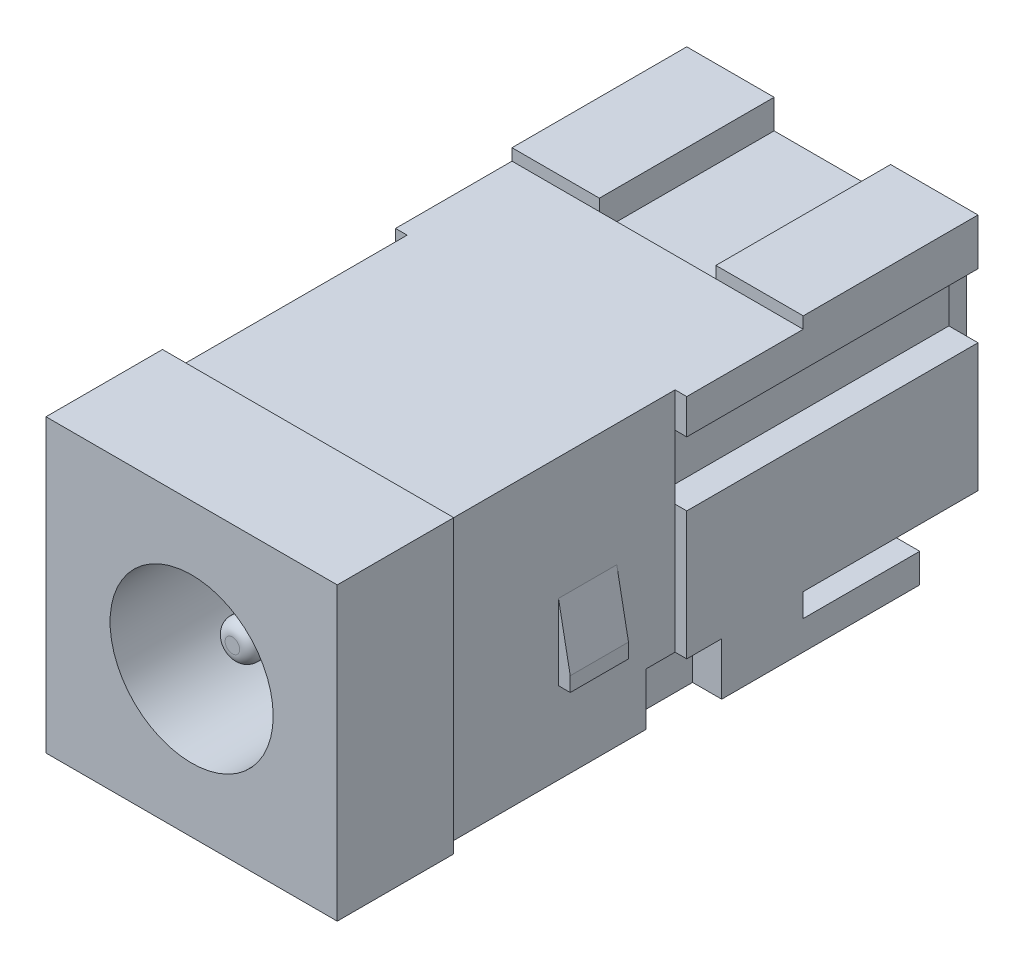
ISO-10303-21;
HEADER;
FILE_DESCRIPTION(('STEP AP214'),'2;1');
FILE_NAME('part.step','',(''),(''),'','','');
FILE_SCHEMA(('AUTOMOTIVE_DESIGN { 1 0 10303 214 1 1 1 1 }'));
ENDSEC;
DATA;
#1=APPLICATION_CONTEXT('core data for automotive mechanical design processes');
#2=APPLICATION_PROTOCOL_DEFINITION('international standard','automotive_design',2000,#1);
#3=PRODUCT_CONTEXT('',#1,'mechanical');
#4=PRODUCT('Part','Part','',(#3));
#5=PRODUCT_RELATED_PRODUCT_CATEGORY('part','',(#4));
#6=PRODUCT_DEFINITION_FORMATION('','',#4);
#7=PRODUCT_DEFINITION_CONTEXT('part definition',#1,'design');
#8=PRODUCT_DEFINITION('design','',#6,#7);
#9=PRODUCT_DEFINITION_SHAPE('','',#8);
#10=(LENGTH_UNIT() NAMED_UNIT(*) SI_UNIT(.MILLI.,.METRE.));
#11=(NAMED_UNIT(*) PLANE_ANGLE_UNIT() SI_UNIT($,.RADIAN.));
#12=(NAMED_UNIT(*) SI_UNIT($,.STERADIAN.) SOLID_ANGLE_UNIT());
#13=UNCERTAINTY_MEASURE_WITH_UNIT(LENGTH_MEASURE(1.E-05),#10,'distance_accuracy_value','');
#14=(GEOMETRIC_REPRESENTATION_CONTEXT(3) GLOBAL_UNCERTAINTY_ASSIGNED_CONTEXT((#13)) GLOBAL_UNIT_ASSIGNED_CONTEXT((#10,
#11,#12)) REPRESENTATION_CONTEXT('',''));
#15=CARTESIAN_POINT('',(0.,0.,0.));
#16=DIRECTION('',(0.,0.,1.));
#17=DIRECTION('',(1.,0.,0.));
#18=AXIS2_PLACEMENT_3D('',#15,#16,#17);
#19=CARTESIAN_POINT('',(0.,2.5,-0.9));
#20=DIRECTION('',(0.,0.,-1.));
#21=DIRECTION('',(-1.,0.,0.));
#22=AXIS2_PLACEMENT_3D('',#19,#20,#21);
#23=DEGENERATE_TOROIDAL_SURFACE('',#22,0.125,0.2,.T.);
#24=CARTESIAN_POINT('',(0.,2.5,-0.7));
#25=DIRECTION('',(0.,0.,1.));
#26=DIRECTION('',(-1.,0.,0.));
#27=AXIS2_PLACEMENT_3D('',#24,#25,#26);
#28=CIRCLE('',#27,0.125);
#29=CARTESIAN_POINT('',(-0.125,2.5,-0.7));
#30=VERTEX_POINT('',#29);
#31=EDGE_CURVE('E39',#30,#30,#28,.T.);
#32=ORIENTED_EDGE('',*,*,#31,.F.);
#33=EDGE_LOOP('',(#32));
#34=FACE_BOUND('',#33,.T.);
#35=CARTESIAN_POINT('',(0.,2.5,-0.9));
#36=DIRECTION('',(0.,0.,-1.));
#37=DIRECTION('',(-1.,0.,0.));
#38=AXIS2_PLACEMENT_3D('',#35,#36,#37);
#39=CIRCLE('',#38,0.325);
#40=CARTESIAN_POINT('',(-0.325,2.5,-0.9));
#41=VERTEX_POINT('',#40);
#42=EDGE_CURVE('E10',#41,#41,#39,.T.);
#43=ORIENTED_EDGE('',*,*,#42,.F.);
#44=EDGE_LOOP('',(#43));
#45=FACE_BOUND('',#44,.T.);
#46=ADVANCED_FACE('F15',(#34,#45),#23,.T.);
#47=CARTESIAN_POINT('',(0.,2.5,0.919238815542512));
#48=DIRECTION('',(0.,0.,-1.));
#49=DIRECTION('',(-1.,0.,0.));
#50=AXIS2_PLACEMENT_3D('',#47,#48,#49);
#51=CYLINDRICAL_SURFACE('',#50,0.325);
#52=ORIENTED_EDGE('',*,*,#42,.T.);
#53=EDGE_LOOP('',(#52));
#54=FACE_BOUND('',#53,.T.);
#55=CARTESIAN_POINT('',(0.,2.5,-6.));
#56=DIRECTION('',(0.,0.,1.));
#57=DIRECTION('',(1.,0.,0.));
#58=AXIS2_PLACEMENT_3D('',#55,#56,#57);
#59=CIRCLE('',#58,0.325);
#60=CARTESIAN_POINT('',(-0.325,2.5,-6.));
#61=VERTEX_POINT('',#60);
#62=EDGE_CURVE('E26',#61,#61,#59,.T.);
#63=ORIENTED_EDGE('',*,*,#62,.T.);
#64=EDGE_LOOP('',(#63));
#65=FACE_BOUND('',#64,.T.);
#66=ADVANCED_FACE('F2789',(#54,#65),#51,.T.);
#67=CARTESIAN_POINT('',(0.,-0.6,-3.));
#68=DIRECTION('',(0.,1.,0.));
#69=DIRECTION('',(0.,0.,1.));
#70=AXIS2_PLACEMENT_3D('',#67,#68,#69);
#71=TOROIDAL_SURFACE('',#70,0.55,0.2);
#72=CARTESIAN_POINT('',(0.,-0.8,-3.));
#73=DIRECTION('',(0.,-1.,0.));
#74=DIRECTION('',(0.,0.,1.));
#75=AXIS2_PLACEMENT_3D('',#72,#73,#74);
#76=CIRCLE('',#75,0.55);
#77=CARTESIAN_POINT('',(0.,-0.8,-2.45));
#78=VERTEX_POINT('',#77);
#79=EDGE_CURVE('E937',#78,#78,#76,.T.);
#80=ORIENTED_EDGE('',*,*,#79,.F.);
#81=EDGE_LOOP('',(#80));
#82=FACE_BOUND('',#81,.T.);
#83=CARTESIAN_POINT('',(0.,-0.6,-3.));
#84=DIRECTION('',(0.,1.,0.));
#85=DIRECTION('',(0.,0.,1.));
#86=AXIS2_PLACEMENT_3D('',#83,#84,#85);
#87=CIRCLE('',#86,0.75);
#88=CARTESIAN_POINT('',(0.,-0.6,-2.25));
#89=VERTEX_POINT('',#88);
#90=EDGE_CURVE('E1218',#89,#89,#87,.T.);
#91=ORIENTED_EDGE('',*,*,#90,.F.);
#92=EDGE_LOOP('',(#91));
#93=FACE_BOUND('',#92,.T.);
#94=ADVANCED_FACE('F2793',(#82,#93),#71,.T.);
#95=CARTESIAN_POINT('',(0.,-0.6,-8.5));
#96=DIRECTION('',(0.,1.,0.));
#97=DIRECTION('',(0.,0.,1.));
#98=AXIS2_PLACEMENT_3D('',#95,#96,#97);
#99=TOROIDAL_SURFACE('',#98,0.55,0.2);
#100=CARTESIAN_POINT('',(0.,-0.8,-8.5));
#101=DIRECTION('',(0.,-1.,0.));
#102=DIRECTION('',(0.,0.,1.));
#103=AXIS2_PLACEMENT_3D('',#100,#101,#102);
#104=CIRCLE('',#103,0.55);
#105=CARTESIAN_POINT('',(0.,-0.8,-7.95));
#106=VERTEX_POINT('',#105);
#107=EDGE_CURVE('E1352',#106,#106,#104,.T.);
#108=ORIENTED_EDGE('',*,*,#107,.F.);
#109=EDGE_LOOP('',(#108));
#110=FACE_BOUND('',#109,.T.);
#111=CARTESIAN_POINT('',(0.,-0.6,-8.5));
#112=DIRECTION('',(0.,1.,0.));
#113=DIRECTION('',(0.,0.,1.));
#114=AXIS2_PLACEMENT_3D('',#111,#112,#113);
#115=CIRCLE('',#114,0.75);
#116=CARTESIAN_POINT('',(0.,-0.6,-7.75));
#117=VERTEX_POINT('',#116);
#118=EDGE_CURVE('E928',#117,#117,#115,.T.);
#119=ORIENTED_EDGE('',*,*,#118,.F.);
#120=EDGE_LOOP('',(#119));
#121=FACE_BOUND('',#120,.T.);
#122=ADVANCED_FACE('F2815',(#110,#121),#99,.T.);
#123=CARTESIAN_POINT('',(0.,-0.8,-8.5));
#124=DIRECTION('',(0.,1.,0.));
#125=DIRECTION('',(0.,0.,1.));
#126=AXIS2_PLACEMENT_3D('',#123,#124,#125);
#127=CYLINDRICAL_SURFACE('',#126,0.75);
#128=ORIENTED_EDGE('',*,*,#118,.T.);
#129=EDGE_LOOP('',(#128));
#130=FACE_BOUND('',#129,.T.);
#131=CARTESIAN_POINT('',(0.,0.,-8.5));
#132=DIRECTION('',(0.,-1.,0.));
#133=DIRECTION('',(0.,0.,-1.));
#134=AXIS2_PLACEMENT_3D('',#131,#132,#133);
#135=CIRCLE('',#134,0.75);
#136=CARTESIAN_POINT('',(0.,0.,-7.75));
#137=VERTEX_POINT('',#136);
#138=EDGE_CURVE('E932',#137,#137,#135,.T.);
#139=ORIENTED_EDGE('',*,*,#138,.T.);
#140=EDGE_LOOP('',(#139));
#141=FACE_BOUND('',#140,.T.);
#142=ADVANCED_FACE('F3399',(#130,#141),#127,.T.);
#143=CARTESIAN_POINT('',(0.,-0.8,-3.));
#144=DIRECTION('',(0.,1.,0.));
#145=DIRECTION('',(0.,0.,1.));
#146=AXIS2_PLACEMENT_3D('',#143,#144,#145);
#147=CYLINDRICAL_SURFACE('',#146,0.75);
#148=ORIENTED_EDGE('',*,*,#90,.T.);
#149=EDGE_LOOP('',(#148));
#150=FACE_BOUND('',#149,.T.);
#151=CARTESIAN_POINT('',(0.,0.,-3.));
#152=DIRECTION('',(0.,-1.,0.));
#153=DIRECTION('',(0.,0.,-1.));
#154=AXIS2_PLACEMENT_3D('',#151,#152,#153);
#155=CIRCLE('',#154,0.75);
#156=CARTESIAN_POINT('',(0.,0.,-2.25));
#157=VERTEX_POINT('',#156);
#158=EDGE_CURVE('E1222',#157,#157,#155,.T.);
#159=ORIENTED_EDGE('',*,*,#158,.T.);
#160=EDGE_LOOP('',(#159));
#161=FACE_BOUND('',#160,.T.);
#162=ADVANCED_FACE('F3075',(#150,#161),#147,.T.);
#163=CARTESIAN_POINT('',(0.,2.5,-6.));
#164=DIRECTION('',(0.,0.,1.));
#165=DIRECTION('',(1.,0.,0.));
#166=AXIS2_PLACEMENT_3D('',#163,#164,#165);
#167=CYLINDRICAL_SURFACE('',#166,1.4);
#168=CARTESIAN_POINT('',(0.,2.5,-6.));
#169=DIRECTION('',(0.,0.,1.));
#170=DIRECTION('',(1.,0.,0.));
#171=AXIS2_PLACEMENT_3D('',#168,#169,#170);
#172=CIRCLE('',#171,1.4);
#173=CARTESIAN_POINT('',(1.4,2.5,-6.));
#174=VERTEX_POINT('',#173);
#175=EDGE_CURVE('E621',#174,#174,#172,.T.);
#176=ORIENTED_EDGE('',*,*,#175,.F.);
#177=EDGE_LOOP('',(#176));
#178=FACE_BOUND('',#177,.T.);
#179=CARTESIAN_POINT('',(0.,2.5,0.));
#180=DIRECTION('',(0.,0.,1.));
#181=DIRECTION('',(1.,0.,0.));
#182=AXIS2_PLACEMENT_3D('',#179,#180,#181);
#183=CIRCLE('',#182,1.4);
#184=CARTESIAN_POINT('',(1.4,2.5,0.));
#185=VERTEX_POINT('',#184);
#186=EDGE_CURVE('E921',#185,#185,#183,.T.);
#187=ORIENTED_EDGE('',*,*,#186,.T.);
#188=EDGE_LOOP('',(#187));
#189=FACE_BOUND('',#188,.T.);
#190=ADVANCED_FACE('F622',(#178,#189),#167,.F.);
#191=CARTESIAN_POINT('',(2.3,0.,-10.));
#192=DIRECTION('',(0.,0.,-1.));
#193=DIRECTION('',(0.,-1.,0.));
#194=AXIS2_PLACEMENT_3D('',#191,#192,#193);
#195=PLANE('',#194);
#196=DIRECTION('',(1.,0.,0.));
#197=VECTOR('',#196,1.);
#198=CARTESIAN_POINT('',(2.3,0.900000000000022,-10.));
#199=LINE('',#198,#197);
#200=CARTESIAN_POINT('',(-1.9,0.900000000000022,-10.));
#201=VERTEX_POINT('',#200);
#202=CARTESIAN_POINT('',(1.5,0.900000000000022,-10.));
#203=VERTEX_POINT('',#202);
#204=EDGE_CURVE('E1050',#201,#203,#199,.T.);
#205=ORIENTED_EDGE('',*,*,#204,.F.);
#206=DIRECTION('',(0.,-1.,0.));
#207=VECTOR('',#206,1.);
#208=CARTESIAN_POINT('',(-1.9,1.35,-10.));
#209=LINE('',#208,#207);
#210=CARTESIAN_POINT('',(-1.9,1.35,-10.));
#211=VERTEX_POINT('',#210);
#212=EDGE_CURVE('E654',#211,#201,#209,.T.);
#213=ORIENTED_EDGE('',*,*,#212,.F.);
#214=DIRECTION('',(-1.,0.,0.));
#215=VECTOR('',#214,1.);
#216=CARTESIAN_POINT('',(2.1,1.35,-10.));
#217=LINE('',#216,#215);
#218=CARTESIAN_POINT('',(1.5,1.35,-10.));
#219=VERTEX_POINT('',#218);
#220=EDGE_CURVE('E19',#219,#211,#217,.T.);
#221=ORIENTED_EDGE('',*,*,#220,.F.);
#222=DIRECTION('',(0.,1.,0.));
#223=VECTOR('',#222,1.);
#224=CARTESIAN_POINT('',(1.5,0.499999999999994,-10.));
#225=LINE('',#224,#223);
#226=EDGE_CURVE('E659',#203,#219,#225,.T.);
#227=ORIENTED_EDGE('',*,*,#226,.F.);
#228=EDGE_LOOP('',(#205,#213,#221,#227));
#229=FACE_BOUND('',#228,.T.);
#230=ADVANCED_FACE('F2705',(#229),#195,.T.);
#231=CARTESIAN_POINT('',(0.45,3.15,-12.));
#232=DIRECTION('',(1.,0.,0.));
#233=DIRECTION('',(0.,0.,1.));
#234=AXIS2_PLACEMENT_3D('',#231,#232,#233);
#235=PLANE('',#234);
#236=DIRECTION('',(0.,0.,1.));
#237=VECTOR('',#236,1.);
#238=CARTESIAN_POINT('',(0.45,1.75,-12.));
#239=LINE('',#238,#237);
#240=CARTESIAN_POINT('',(0.45,1.75,-12.));
#241=VERTEX_POINT('',#240);
#242=CARTESIAN_POINT('',(0.45,1.75,-11.5));
#243=VERTEX_POINT('',#242);
#244=EDGE_CURVE('E918',#241,#243,#239,.T.);
#245=ORIENTED_EDGE('',*,*,#244,.T.);
#246=DIRECTION('',(0.,1.,0.));
#247=VECTOR('',#246,1.);
#248=CARTESIAN_POINT('',(0.45,3.15,-11.5));
#249=LINE('',#248,#247);
#250=CARTESIAN_POINT('',(0.45,3.15,-11.5));
#251=VERTEX_POINT('',#250);
#252=EDGE_CURVE('E922',#243,#251,#249,.T.);
#253=ORIENTED_EDGE('',*,*,#252,.T.);
#254=DIRECTION('',(0.,0.,1.));
#255=VECTOR('',#254,1.);
#256=CARTESIAN_POINT('',(0.45,3.15,-12.));
#257=LINE('',#256,#255);
#258=CARTESIAN_POINT('',(0.45,3.15,-12.));
#259=VERTEX_POINT('',#258);
#260=EDGE_CURVE('E1241',#259,#251,#257,.T.);
#261=ORIENTED_EDGE('',*,*,#260,.F.);
#262=DIRECTION('',(0.,1.,0.));
#263=VECTOR('',#262,1.);
#264=CARTESIAN_POINT('',(0.45,3.15,-12.));
#265=LINE('',#264,#263);
#266=EDGE_CURVE('E1032',#241,#259,#265,.T.);
#267=ORIENTED_EDGE('',*,*,#266,.F.);
#268=EDGE_LOOP('',(#245,#253,#261,#267));
#269=FACE_BOUND('',#268,.T.);
#270=ADVANCED_FACE('F1413',(#269),#235,.F.);
#271=CARTESIAN_POINT('',(-0.45,3.15,-12.));
#272=DIRECTION('',(-1.,0.,0.));
#273=DIRECTION('',(0.,1.,0.));
#274=AXIS2_PLACEMENT_3D('',#271,#272,#273);
#275=PLANE('',#274);
#276=DIRECTION('',(0.,0.,1.));
#277=VECTOR('',#276,1.);
#278=CARTESIAN_POINT('',(-0.45,3.15,-12.));
#279=LINE('',#278,#277);
#280=CARTESIAN_POINT('',(-0.45,3.15,-12.));
#281=VERTEX_POINT('',#280);
#282=CARTESIAN_POINT('',(-0.45,3.15,-11.5));
#283=VERTEX_POINT('',#282);
#284=EDGE_CURVE('E967',#281,#283,#279,.T.);
#285=ORIENTED_EDGE('',*,*,#284,.T.);
#286=DIRECTION('',(0.,-1.,0.));
#287=VECTOR('',#286,1.);
#288=CARTESIAN_POINT('',(-0.45,3.15,-11.5));
#289=LINE('',#288,#287);
#290=CARTESIAN_POINT('',(-0.45,1.75,-11.5));
#291=VERTEX_POINT('',#290);
#292=EDGE_CURVE('E689',#283,#291,#289,.T.);
#293=ORIENTED_EDGE('',*,*,#292,.T.);
#294=DIRECTION('',(0.,0.,1.));
#295=VECTOR('',#294,1.);
#296=CARTESIAN_POINT('',(-0.45,1.75,-12.));
#297=LINE('',#296,#295);
#298=CARTESIAN_POINT('',(-0.45,1.75,-12.));
#299=VERTEX_POINT('',#298);
#300=EDGE_CURVE('E809',#299,#291,#297,.T.);
#301=ORIENTED_EDGE('',*,*,#300,.F.);
#302=DIRECTION('',(0.,-1.,0.));
#303=VECTOR('',#302,1.);
#304=CARTESIAN_POINT('',(-0.45,3.15,-12.));
#305=LINE('',#304,#303);
#306=EDGE_CURVE('E737',#281,#299,#305,.T.);
#307=ORIENTED_EDGE('',*,*,#306,.F.);
#308=EDGE_LOOP('',(#285,#293,#301,#307));
#309=FACE_BOUND('',#308,.T.);
#310=ADVANCED_FACE('F2704',(#309),#275,.F.);
#311=CARTESIAN_POINT('',(-2.3,0.,0.));
#312=DIRECTION('',(-1.,0.,0.));
#313=DIRECTION('',(0.,0.,1.));
#314=AXIS2_PLACEMENT_3D('',#311,#312,#313);
#315=PLANE('',#314);
#316=DIRECTION('',(0.,-1.,0.));
#317=VECTOR('',#316,1.);
#318=CARTESIAN_POINT('',(-2.3,0.,-6.));
#319=LINE('',#318,#317);
#320=CARTESIAN_POINT('',(-2.3,3.1,-6.));
#321=VERTEX_POINT('',#320);
#322=CARTESIAN_POINT('',(-2.3,0.899999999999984,-6.));
#323=VERTEX_POINT('',#322);
#324=EDGE_CURVE('E685',#321,#323,#319,.T.);
#325=ORIENTED_EDGE('',*,*,#324,.T.);
#326=DIRECTION('',(0.,0.,1.));
#327=VECTOR('',#326,1.);
#328=CARTESIAN_POINT('',(-2.3,0.899999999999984,0.));
#329=LINE('',#328,#327);
#330=CARTESIAN_POINT('',(-2.3,0.899999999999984,-5.5));
#331=VERTEX_POINT('',#330);
#332=EDGE_CURVE('E690',#323,#331,#329,.T.);
#333=ORIENTED_EDGE('',*,*,#332,.T.);
#334=DIRECTION('',(0.,-1.,0.));
#335=VECTOR('',#334,1.);
#336=CARTESIAN_POINT('',(-2.3,0.,-5.5));
#337=LINE('',#336,#335);
#338=CARTESIAN_POINT('',(-2.3,0.,-5.5));
#339=VERTEX_POINT('',#338);
#340=EDGE_CURVE('E961',#331,#339,#337,.T.);
#341=ORIENTED_EDGE('',*,*,#340,.T.);
#342=DIRECTION('',(0.,0.,1.));
#343=VECTOR('',#342,1.);
#344=CARTESIAN_POINT('',(-2.3,0.,0.));
#345=LINE('',#344,#343);
#346=CARTESIAN_POINT('',(-2.3,0.,-2.));
#347=VERTEX_POINT('',#346);
#348=EDGE_CURVE('E1010',#339,#347,#345,.T.);
#349=ORIENTED_EDGE('',*,*,#348,.T.);
#350=DIRECTION('',(0.,-1.,0.));
#351=VECTOR('',#350,1.);
#352=CARTESIAN_POINT('',(-2.3,0.,-2.));
#353=LINE('',#352,#351);
#354=CARTESIAN_POINT('',(-2.3,4.8,-2.));
#355=VERTEX_POINT('',#354);
#356=EDGE_CURVE('E720',#355,#347,#353,.T.);
#357=ORIENTED_EDGE('',*,*,#356,.F.);
#358=DIRECTION('',(0.,0.,-1.));
#359=VECTOR('',#358,1.);
#360=CARTESIAN_POINT('',(-2.3,4.8,0.));
#361=LINE('',#360,#359);
#362=CARTESIAN_POINT('',(-2.3,4.8,-6.));
#363=VERTEX_POINT('',#362);
#364=EDGE_CURVE('E1006',#355,#363,#361,.T.);
#365=ORIENTED_EDGE('',*,*,#364,.T.);
#366=DIRECTION('',(0.,-1.,0.));
#367=VECTOR('',#366,1.);
#368=CARTESIAN_POINT('',(-2.3,0.,-6.));
#369=LINE('',#368,#367);
#370=CARTESIAN_POINT('',(-2.3,4.20000000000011,-6.));
#371=VERTEX_POINT('',#370);
#372=EDGE_CURVE('E1011',#363,#371,#369,.T.);
#373=ORIENTED_EDGE('',*,*,#372,.T.);
#374=DIRECTION('',(0.,-1.,0.));
#375=VECTOR('',#374,1.);
#376=CARTESIAN_POINT('',(-2.3,0.,-6.));
#377=LINE('',#376,#375);
#378=EDGE_CURVE('E635',#371,#321,#377,.T.);
#379=ORIENTED_EDGE('',*,*,#378,.T.);
#380=EDGE_LOOP('',(#325,#333,#341,#349,#357,#365,#373,#379));
#381=FACE_BOUND('',#380,.T.);
#382=DIRECTION('',(0.,0.999999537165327,0.000962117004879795));
#383=VECTOR('',#382,1.);
#384=CARTESIAN_POINT('',(-2.3,1.4,-4.));
#385=LINE('',#384,#383);
#386=CARTESIAN_POINT('',(-2.3,1.4,-4.));
#387=VERTEX_POINT('',#386);
#388=CARTESIAN_POINT('',(-2.3,2.69999939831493,-3.99874924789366));
#389=VERTEX_POINT('',#388);
#390=EDGE_CURVE('E667',#387,#389,#385,.T.);
#391=ORIENTED_EDGE('',*,*,#390,.F.);
#392=DIRECTION('',(0.,0.,1.));
#393=VECTOR('',#392,1.);
#394=CARTESIAN_POINT('',(-2.3,1.4,-5.00000000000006));
#395=LINE('',#394,#393);
#396=CARTESIAN_POINT('',(-2.3,1.4,-5.00000000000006));
#397=VERTEX_POINT('',#396);
#398=EDGE_CURVE('E671',#397,#387,#395,.T.);
#399=ORIENTED_EDGE('',*,*,#398,.F.);
#400=DIRECTION('',(0.,-0.999999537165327,-0.000962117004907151));
#401=VECTOR('',#400,1.);
#402=CARTESIAN_POINT('',(-2.3,2.69999939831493,-4.99874924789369));
#403=LINE('',#402,#401);
#404=CARTESIAN_POINT('',(-2.3,2.69999939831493,-4.99874924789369));
#405=VERTEX_POINT('',#404);
#406=EDGE_CURVE('E841',#405,#397,#403,.T.);
#407=ORIENTED_EDGE('',*,*,#406,.F.);
#408=DIRECTION('',(0.,0.,-1.));
#409=VECTOR('',#408,1.);
#410=CARTESIAN_POINT('',(-2.3,2.69999939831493,-3.99874924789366));
#411=LINE('',#410,#409);
#412=EDGE_CURVE('E1079',#389,#405,#411,.T.);
#413=ORIENTED_EDGE('',*,*,#412,.F.);
#414=EDGE_LOOP('',(#391,#399,#407,#413));
#415=FACE_BOUND('',#414,.T.);
#416=ADVANCED_FACE('F2868',(#381,#415),#315,.T.);
#417=CARTESIAN_POINT('',(2.3,0.,0.));
#418=DIRECTION('',(1.,0.,0.));
#419=DIRECTION('',(0.,1.,0.));
#420=AXIS2_PLACEMENT_3D('',#417,#418,#419);
#421=PLANE('',#420);
#422=DIRECTION('',(0.,-1.,0.));
#423=VECTOR('',#422,1.);
#424=CARTESIAN_POINT('',(2.3,0.,-5.5));
#425=LINE('',#424,#423);
#426=CARTESIAN_POINT('',(2.3,0.899999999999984,-5.5));
#427=VERTEX_POINT('',#426);
#428=CARTESIAN_POINT('',(2.3,0.,-5.5));
#429=VERTEX_POINT('',#428);
#430=EDGE_CURVE('E1069',#427,#429,#425,.T.);
#431=ORIENTED_EDGE('',*,*,#430,.F.);
#432=DIRECTION('',(0.,0.,1.));
#433=VECTOR('',#432,1.);
#434=CARTESIAN_POINT('',(2.3,0.899999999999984,0.));
#435=LINE('',#434,#433);
#436=CARTESIAN_POINT('',(2.3,0.899999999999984,-6.));
#437=VERTEX_POINT('',#436);
#438=EDGE_CURVE('E837',#437,#427,#435,.T.);
#439=ORIENTED_EDGE('',*,*,#438,.F.);
#440=DIRECTION('',(0.,-1.,0.));
#441=VECTOR('',#440,1.);
#442=CARTESIAN_POINT('',(2.3,0.,-6.));
#443=LINE('',#442,#441);
#444=CARTESIAN_POINT('',(2.3,3.1,-6.));
#445=VERTEX_POINT('',#444);
#446=EDGE_CURVE('E836',#445,#437,#443,.T.);
#447=ORIENTED_EDGE('',*,*,#446,.F.);
#448=DIRECTION('',(0.,-1.,0.));
#449=VECTOR('',#448,1.);
#450=CARTESIAN_POINT('',(2.3,0.,-6.));
#451=LINE('',#450,#449);
#452=CARTESIAN_POINT('',(2.3,4.20000000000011,-6.));
#453=VERTEX_POINT('',#452);
#454=EDGE_CURVE('E986',#453,#445,#451,.T.);
#455=ORIENTED_EDGE('',*,*,#454,.F.);
#456=DIRECTION('',(0.,-1.,0.));
#457=VECTOR('',#456,1.);
#458=CARTESIAN_POINT('',(2.3,0.,-6.));
#459=LINE('',#458,#457);
#460=CARTESIAN_POINT('',(2.3,4.8,-6.));
#461=VERTEX_POINT('',#460);
#462=EDGE_CURVE('E775',#461,#453,#459,.T.);
#463=ORIENTED_EDGE('',*,*,#462,.F.);
#464=DIRECTION('',(0.,0.,-1.));
#465=VECTOR('',#464,1.);
#466=CARTESIAN_POINT('',(2.3,4.8,0.));
#467=LINE('',#466,#465);
#468=CARTESIAN_POINT('',(2.3,4.8,-2.));
#469=VERTEX_POINT('',#468);
#470=EDGE_CURVE('E867',#469,#461,#467,.T.);
#471=ORIENTED_EDGE('',*,*,#470,.F.);
#472=DIRECTION('',(0.,-1.,0.));
#473=VECTOR('',#472,1.);
#474=CARTESIAN_POINT('',(2.3,0.,-2.));
#475=LINE('',#474,#473);
#476=CARTESIAN_POINT('',(2.3,0.,-2.));
#477=VERTEX_POINT('',#476);
#478=EDGE_CURVE('E626',#469,#477,#475,.T.);
#479=ORIENTED_EDGE('',*,*,#478,.T.);
#480=DIRECTION('',(0.,0.,1.));
#481=VECTOR('',#480,1.);
#482=CARTESIAN_POINT('',(2.3,0.,0.));
#483=LINE('',#482,#481);
#484=EDGE_CURVE('E1055',#429,#477,#483,.T.);
#485=ORIENTED_EDGE('',*,*,#484,.F.);
#486=EDGE_LOOP('',(#431,#439,#447,#455,#463,#471,#479,#485));
#487=FACE_BOUND('',#486,.T.);
#488=DIRECTION('',(0.,-0.999999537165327,-0.000962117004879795));
#489=VECTOR('',#488,1.);
#490=CARTESIAN_POINT('',(2.3,2.69999939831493,-3.99874924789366));
#491=LINE('',#490,#489);
#492=CARTESIAN_POINT('',(2.3,2.69999939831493,-3.99874924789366));
#493=VERTEX_POINT('',#492);
#494=CARTESIAN_POINT('',(2.3,1.4,-4.));
#495=VERTEX_POINT('',#494);
#496=EDGE_CURVE('E725',#493,#495,#491,.T.);
#497=ORIENTED_EDGE('',*,*,#496,.F.);
#498=DIRECTION('',(0.,0.,1.));
#499=VECTOR('',#498,1.);
#500=CARTESIAN_POINT('',(2.3,2.69999939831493,-3.99874924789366));
#501=LINE('',#500,#499);
#502=CARTESIAN_POINT('',(2.3,2.69999939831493,-4.99874924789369));
#503=VERTEX_POINT('',#502);
#504=EDGE_CURVE('E1075',#503,#493,#501,.T.);
#505=ORIENTED_EDGE('',*,*,#504,.F.);
#506=DIRECTION('',(0.,0.999999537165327,0.000962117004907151));
#507=VECTOR('',#506,1.);
#508=CARTESIAN_POINT('',(2.3,2.69999939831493,-4.99874924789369));
#509=LINE('',#508,#507);
#510=CARTESIAN_POINT('',(2.3,1.4,-5.00000000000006));
#511=VERTEX_POINT('',#510);
#512=EDGE_CURVE('E1040',#511,#503,#509,.T.);
#513=ORIENTED_EDGE('',*,*,#512,.F.);
#514=DIRECTION('',(0.,0.,-1.));
#515=VECTOR('',#514,1.);
#516=CARTESIAN_POINT('',(2.3,1.4,-4.));
#517=LINE('',#516,#515);
#518=EDGE_CURVE('E1051',#495,#511,#517,.T.);
#519=ORIENTED_EDGE('',*,*,#518,.F.);
#520=EDGE_LOOP('',(#497,#505,#513,#519));
#521=FACE_BOUND('',#520,.T.);
#522=ADVANCED_FACE('F1539',(#487,#521),#421,.T.);
#523=CARTESIAN_POINT('',(0.,2.5,-6.));
#524=DIRECTION('',(0.,0.,1.));
#525=DIRECTION('',(1.,0.,0.));
#526=AXIS2_PLACEMENT_3D('',#523,#524,#525);
#527=PLANE('',#526);
#528=ORIENTED_EDGE('',*,*,#175,.T.);
#529=EDGE_LOOP('',(#528));
#530=FACE_BOUND('',#529,.T.);
#531=ORIENTED_EDGE('',*,*,#62,.F.);
#532=EDGE_LOOP('',(#531));
#533=FACE_BOUND('',#532,.T.);
#534=ADVANCED_FACE('F2679',(#530,#533),#527,.T.);
#535=CARTESIAN_POINT('',(-2.5,5.,-11.));
#536=DIRECTION('',(0.,0.,-1.));
#537=DIRECTION('',(0.,-1.,0.));
#538=AXIS2_PLACEMENT_3D('',#535,#536,#537);
#539=PLANE('',#538);
#540=DIRECTION('',(-1.,0.,0.));
#541=VECTOR('',#540,1.);
#542=CARTESIAN_POINT('',(-2.5,1.35,-11.));
#543=LINE('',#542,#541);
#544=CARTESIAN_POINT('',(-1.9,1.35,-11.));
#545=VERTEX_POINT('',#544);
#546=CARTESIAN_POINT('',(-2.5,1.35,-11.));
#547=VERTEX_POINT('',#546);
#548=EDGE_CURVE('E650',#545,#547,#543,.T.);
#549=ORIENTED_EDGE('',*,*,#548,.F.);
#550=DIRECTION('',(0.,1.,0.));
#551=VECTOR('',#550,1.);
#552=CARTESIAN_POINT('',(-1.9,1.35,-11.));
#553=LINE('',#552,#551);
#554=CARTESIAN_POINT('',(-1.9,0.900000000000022,-11.));
#555=VERTEX_POINT('',#554);
#556=EDGE_CURVE('E1266',#555,#545,#553,.T.);
#557=ORIENTED_EDGE('',*,*,#556,.F.);
#558=DIRECTION('',(-1.,0.,0.));
#559=VECTOR('',#558,1.);
#560=CARTESIAN_POINT('',(-2.3,0.900000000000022,-11.));
#561=LINE('',#560,#559);
#562=CARTESIAN_POINT('',(-2.5,0.900000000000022,-11.));
#563=VERTEX_POINT('',#562);
#564=EDGE_CURVE('E627',#555,#563,#561,.T.);
#565=ORIENTED_EDGE('',*,*,#564,.T.);
#566=DIRECTION('',(0.,-1.,0.));
#567=VECTOR('',#566,1.);
#568=CARTESIAN_POINT('',(-2.5,0.,-11.));
#569=LINE('',#568,#567);
#570=EDGE_CURVE('E975',#547,#563,#569,.T.);
#571=ORIENTED_EDGE('',*,*,#570,.F.);
#572=EDGE_LOOP('',(#549,#557,#565,#571));
#573=FACE_BOUND('',#572,.T.);
#574=ADVANCED_FACE('F2674',(#573),#539,.T.);
#575=CARTESIAN_POINT('',(-2.5,0.,-11.));
#576=DIRECTION('',(0.,-1.,0.));
#577=DIRECTION('',(0.,0.,-1.));
#578=AXIS2_PLACEMENT_3D('',#575,#576,#577);
#579=PLANE('',#578);
#580=DIRECTION('',(0.,0.,1.));
#581=VECTOR('',#580,1.);
#582=CARTESIAN_POINT('',(-2.5,0.,-11.));
#583=LINE('',#582,#581);
#584=CARTESIAN_POINT('',(-2.5,0.,-10.));
#585=VERTEX_POINT('',#584);
#586=CARTESIAN_POINT('',(-2.5,0.,-6.6));
#587=VERTEX_POINT('',#586);
#588=EDGE_CURVE('E1143',#585,#587,#583,.T.);
#589=ORIENTED_EDGE('',*,*,#588,.F.);
#590=DIRECTION('',(1.,0.,0.));
#591=VECTOR('',#590,1.);
#592=CARTESIAN_POINT('',(2.3,0.,-10.));
#593=LINE('',#592,#591);
#594=CARTESIAN_POINT('',(2.5,0.,-10.));
#595=VERTEX_POINT('',#594);
#596=EDGE_CURVE('E638',#585,#595,#593,.T.);
#597=ORIENTED_EDGE('',*,*,#596,.T.);
#598=DIRECTION('',(0.,0.,1.));
#599=VECTOR('',#598,1.);
#600=CARTESIAN_POINT('',(2.5,0.,-11.));
#601=LINE('',#600,#599);
#602=CARTESIAN_POINT('',(2.5,0.,-6.6));
#603=VERTEX_POINT('',#602);
#604=EDGE_CURVE('E1166',#595,#603,#601,.T.);
#605=ORIENTED_EDGE('',*,*,#604,.T.);
#606=DIRECTION('',(1.,0.,0.));
#607=VECTOR('',#606,1.);
#608=CARTESIAN_POINT('',(2.3,0.,-6.6));
#609=LINE('',#608,#607);
#610=CARTESIAN_POINT('',(2.,0.,-6.6));
#611=VERTEX_POINT('',#610);
#612=EDGE_CURVE('E1319',#611,#603,#609,.T.);
#613=ORIENTED_EDGE('',*,*,#612,.F.);
#614=DIRECTION('',(0.,0.,-1.));
#615=VECTOR('',#614,1.);
#616=CARTESIAN_POINT('',(2.,0.,-6.6));
#617=LINE('',#616,#615);
#618=CARTESIAN_POINT('',(2.,0.,-5.5));
#619=VERTEX_POINT('',#618);
#620=EDGE_CURVE('E780',#619,#611,#617,.T.);
#621=ORIENTED_EDGE('',*,*,#620,.F.);
#622=DIRECTION('',(1.,0.,0.));
#623=VECTOR('',#622,1.);
#624=CARTESIAN_POINT('',(2.,0.,-5.5));
#625=LINE('',#624,#623);
#626=EDGE_CURVE('E1058',#619,#429,#625,.T.);
#627=ORIENTED_EDGE('',*,*,#626,.T.);
#628=ORIENTED_EDGE('',*,*,#484,.T.);
#629=DIRECTION('',(1.,0.,0.));
#630=VECTOR('',#629,1.);
#631=CARTESIAN_POINT('',(2.3,0.,-2.));
#632=LINE('',#631,#630);
#633=CARTESIAN_POINT('',(2.5,0.,-2.));
#634=VERTEX_POINT('',#633);
#635=EDGE_CURVE('E803',#477,#634,#632,.T.);
#636=ORIENTED_EDGE('',*,*,#635,.T.);
#637=DIRECTION('',(0.,0.,1.));
#638=VECTOR('',#637,1.);
#639=CARTESIAN_POINT('',(2.5,0.,-11.));
#640=LINE('',#639,#638);
#641=CARTESIAN_POINT('',(2.5,0.,0.));
#642=VERTEX_POINT('',#641);
#643=EDGE_CURVE('E799',#634,#642,#640,.T.);
#644=ORIENTED_EDGE('',*,*,#643,.T.);
#645=DIRECTION('',(1.,0.,0.));
#646=VECTOR('',#645,1.);
#647=CARTESIAN_POINT('',(-2.5,0.,0.));
#648=LINE('',#647,#646);
#649=CARTESIAN_POINT('',(-2.5,0.,0.));
#650=VERTEX_POINT('',#649);
#651=EDGE_CURVE('E707',#650,#642,#648,.T.);
#652=ORIENTED_EDGE('',*,*,#651,.F.);
#653=DIRECTION('',(0.,0.,1.));
#654=VECTOR('',#653,1.);
#655=CARTESIAN_POINT('',(-2.5,0.,-11.));
#656=LINE('',#655,#654);
#657=CARTESIAN_POINT('',(-2.5,0.,-2.));
#658=VERTEX_POINT('',#657);
#659=EDGE_CURVE('E830',#658,#650,#656,.T.);
#660=ORIENTED_EDGE('',*,*,#659,.F.);
#661=DIRECTION('',(-1.,0.,0.));
#662=VECTOR('',#661,1.);
#663=CARTESIAN_POINT('',(-2.3,0.,-2.));
#664=LINE('',#663,#662);
#665=EDGE_CURVE('E724',#347,#658,#664,.T.);
#666=ORIENTED_EDGE('',*,*,#665,.F.);
#667=ORIENTED_EDGE('',*,*,#348,.F.);
#668=DIRECTION('',(-1.,0.,0.));
#669=VECTOR('',#668,1.);
#670=CARTESIAN_POINT('',(-2.,0.,-5.5));
#671=LINE('',#670,#669);
#672=CARTESIAN_POINT('',(-2.,0.,-5.5));
#673=VERTEX_POINT('',#672);
#674=EDGE_CURVE('E995',#673,#339,#671,.T.);
#675=ORIENTED_EDGE('',*,*,#674,.F.);
#676=DIRECTION('',(0.,0.,-1.));
#677=VECTOR('',#676,1.);
#678=CARTESIAN_POINT('',(-2.,0.,-6.6));
#679=LINE('',#678,#677);
#680=CARTESIAN_POINT('',(-2.,0.,-6.6));
#681=VERTEX_POINT('',#680);
#682=EDGE_CURVE('E665',#673,#681,#679,.T.);
#683=ORIENTED_EDGE('',*,*,#682,.T.);
#684=DIRECTION('',(-1.,0.,0.));
#685=VECTOR('',#684,1.);
#686=CARTESIAN_POINT('',(-2.3,0.,-6.6));
#687=LINE('',#686,#685);
#688=EDGE_CURVE('E661',#681,#587,#687,.T.);
#689=ORIENTED_EDGE('',*,*,#688,.T.);
#690=EDGE_LOOP('',(#589,#597,#605,#613,#621,#627,#628,#636,#644,#652,#660,#666,#667,#675,#683,#689));
#691=FACE_BOUND('',#690,.T.);
#692=ORIENTED_EDGE('',*,*,#138,.F.);
#693=EDGE_LOOP('',(#692));
#694=FACE_BOUND('',#693,.T.);
#695=ORIENTED_EDGE('',*,*,#158,.F.);
#696=EDGE_LOOP('',(#695));
#697=FACE_BOUND('',#696,.T.);
#698=ADVANCED_FACE('F2678',(#691,#694,#697),#579,.T.);
#699=CARTESIAN_POINT('',(-2.5,5.,-11.));
#700=DIRECTION('',(0.,0.,-1.));
#701=DIRECTION('',(0.,-1.,0.));
#702=AXIS2_PLACEMENT_3D('',#699,#700,#701);
#703=PLANE('',#702);
#704=DIRECTION('',(1.,0.,0.));
#705=VECTOR('',#704,1.);
#706=CARTESIAN_POINT('',(2.3,0.900000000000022,-11.));
#707=LINE('',#706,#705);
#708=CARTESIAN_POINT('',(1.5,0.900000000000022,-11.));
#709=VERTEX_POINT('',#708);
#710=CARTESIAN_POINT('',(2.5,0.900000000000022,-11.));
#711=VERTEX_POINT('',#710);
#712=EDGE_CURVE('E1258',#709,#711,#707,.T.);
#713=ORIENTED_EDGE('',*,*,#712,.F.);
#714=DIRECTION('',(0.,-1.,0.));
#715=VECTOR('',#714,1.);
#716=CARTESIAN_POINT('',(1.5,0.499999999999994,-11.));
#717=LINE('',#716,#715);
#718=CARTESIAN_POINT('',(1.5,1.35,-11.));
#719=VERTEX_POINT('',#718);
#720=EDGE_CURVE('E1176',#719,#709,#717,.T.);
#721=ORIENTED_EDGE('',*,*,#720,.F.);
#722=DIRECTION('',(-1.,0.,0.));
#723=VECTOR('',#722,1.);
#724=CARTESIAN_POINT('',(1.5,1.35,-11.));
#725=LINE('',#724,#723);
#726=CARTESIAN_POINT('',(2.1,1.35,-11.));
#727=VERTEX_POINT('',#726);
#728=EDGE_CURVE('E1231',#727,#719,#725,.T.);
#729=ORIENTED_EDGE('',*,*,#728,.F.);
#730=DIRECTION('',(0.,-1.,0.));
#731=VECTOR('',#730,1.);
#732=CARTESIAN_POINT('',(2.1,1.35,-11.));
#733=LINE('',#732,#731);
#734=CARTESIAN_POINT('',(2.1,1.75,-11.));
#735=VERTEX_POINT('',#734);
#736=EDGE_CURVE('E933',#735,#727,#733,.T.);
#737=ORIENTED_EDGE('',*,*,#736,.F.);
#738=DIRECTION('',(1.,0.,0.));
#739=VECTOR('',#738,1.);
#740=CARTESIAN_POINT('',(2.1,1.75,-11.));
#741=LINE('',#740,#739);
#742=CARTESIAN_POINT('',(1.3,1.75,-11.));
#743=VERTEX_POINT('',#742);
#744=EDGE_CURVE('E752',#743,#735,#741,.T.);
#745=ORIENTED_EDGE('',*,*,#744,.F.);
#746=DIRECTION('',(0.,-1.,0.));
#747=VECTOR('',#746,1.);
#748=CARTESIAN_POINT('',(1.3,3.15,-11.));
#749=LINE('',#748,#747);
#750=CARTESIAN_POINT('',(1.3,3.15,-11.));
#751=VERTEX_POINT('',#750);
#752=EDGE_CURVE('E808',#751,#743,#749,.T.);
#753=ORIENTED_EDGE('',*,*,#752,.F.);
#754=DIRECTION('',(1.,0.,0.));
#755=VECTOR('',#754,1.);
#756=CARTESIAN_POINT('',(1.3,3.15,-11.));
#757=LINE('',#756,#755);
#758=CARTESIAN_POINT('',(0.45,3.15,-11.));
#759=VERTEX_POINT('',#758);
#760=EDGE_CURVE('E1242',#759,#751,#757,.T.);
#761=ORIENTED_EDGE('',*,*,#760,.F.);
#762=DIRECTION('',(0.,1.,0.));
#763=VECTOR('',#762,1.);
#764=CARTESIAN_POINT('',(0.45,3.15,-11.));
#765=LINE('',#764,#763);
#766=CARTESIAN_POINT('',(0.45,1.75,-11.));
#767=VERTEX_POINT('',#766);
#768=EDGE_CURVE('E1201',#767,#759,#765,.T.);
#769=ORIENTED_EDGE('',*,*,#768,.F.);
#770=DIRECTION('',(1.,0.,0.));
#771=VECTOR('',#770,1.);
#772=CARTESIAN_POINT('',(2.1,1.75,-11.));
#773=LINE('',#772,#771);
#774=CARTESIAN_POINT('',(-0.45,1.75,-11.));
#775=VERTEX_POINT('',#774);
#776=EDGE_CURVE('E873',#775,#767,#773,.T.);
#777=ORIENTED_EDGE('',*,*,#776,.F.);
#778=DIRECTION('',(0.,-1.,0.));
#779=VECTOR('',#778,1.);
#780=CARTESIAN_POINT('',(-0.45,3.15,-11.));
#781=LINE('',#780,#779);
#782=CARTESIAN_POINT('',(-0.45,3.15,-11.));
#783=VERTEX_POINT('',#782);
#784=EDGE_CURVE('E784',#783,#775,#781,.T.);
#785=ORIENTED_EDGE('',*,*,#784,.F.);
#786=DIRECTION('',(1.,0.,0.));
#787=VECTOR('',#786,1.);
#788=CARTESIAN_POINT('',(-1.3,3.15,-11.));
#789=LINE('',#788,#787);
#790=CARTESIAN_POINT('',(-1.3,3.15,-11.));
#791=VERTEX_POINT('',#790);
#792=EDGE_CURVE('E1118',#791,#783,#789,.T.);
#793=ORIENTED_EDGE('',*,*,#792,.F.);
#794=DIRECTION('',(0.,1.,0.));
#795=VECTOR('',#794,1.);
#796=CARTESIAN_POINT('',(-1.3,3.15,-11.));
#797=LINE('',#796,#795);
#798=CARTESIAN_POINT('',(-1.3,1.75,-11.));
#799=VERTEX_POINT('',#798);
#800=EDGE_CURVE('E984',#799,#791,#797,.T.);
#801=ORIENTED_EDGE('',*,*,#800,.F.);
#802=DIRECTION('',(1.,0.,0.));
#803=VECTOR('',#802,1.);
#804=CARTESIAN_POINT('',(2.1,1.75,-11.));
#805=LINE('',#804,#803);
#806=CARTESIAN_POINT('',(-2.5,1.75,-11.));
#807=VERTEX_POINT('',#806);
#808=EDGE_CURVE('E1022',#807,#799,#805,.T.);
#809=ORIENTED_EDGE('',*,*,#808,.F.);
#810=DIRECTION('',(0.,-1.,0.));
#811=VECTOR('',#810,1.);
#812=CARTESIAN_POINT('',(-2.5,0.,-11.));
#813=LINE('',#812,#811);
#814=CARTESIAN_POINT('',(-2.5,3.1,-11.));
#815=VERTEX_POINT('',#814);
#816=EDGE_CURVE('E1326',#815,#807,#813,.T.);
#817=ORIENTED_EDGE('',*,*,#816,.F.);
#818=DIRECTION('',(-1.,0.,0.));
#819=VECTOR('',#818,1.);
#820=CARTESIAN_POINT('',(-2.3,3.1,-11.));
#821=LINE('',#820,#819);
#822=CARTESIAN_POINT('',(-2.,3.1,-11.));
#823=VERTEX_POINT('',#822);
#824=EDGE_CURVE('E684',#823,#815,#821,.T.);
#825=ORIENTED_EDGE('',*,*,#824,.F.);
#826=DIRECTION('',(0.,1.,0.));
#827=VECTOR('',#826,1.);
#828=CARTESIAN_POINT('',(-2.,4.20000000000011,-11.));
#829=LINE('',#828,#827);
#830=CARTESIAN_POINT('',(-2.,4.20000000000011,-11.));
#831=VERTEX_POINT('',#830);
#832=EDGE_CURVE('E666',#823,#831,#829,.T.);
#833=ORIENTED_EDGE('',*,*,#832,.T.);
#834=DIRECTION('',(-1.,0.,0.));
#835=VECTOR('',#834,1.);
#836=CARTESIAN_POINT('',(-2.3,4.20000000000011,-11.));
#837=LINE('',#836,#835);
#838=CARTESIAN_POINT('',(-2.5,4.20000000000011,-11.));
#839=VERTEX_POINT('',#838);
#840=EDGE_CURVE('E709',#831,#839,#837,.T.);
#841=ORIENTED_EDGE('',*,*,#840,.T.);
#842=DIRECTION('',(0.,-1.,0.));
#843=VECTOR('',#842,1.);
#844=CARTESIAN_POINT('',(-2.5,0.,-11.));
#845=LINE('',#844,#843);
#846=CARTESIAN_POINT('',(-2.5,5.,-11.));
#847=VERTEX_POINT('',#846);
#848=EDGE_CURVE('E856',#847,#839,#845,.T.);
#849=ORIENTED_EDGE('',*,*,#848,.F.);
#850=DIRECTION('',(-1.,0.,0.));
#851=VECTOR('',#850,1.);
#852=CARTESIAN_POINT('',(-2.5,5.,-11.));
#853=LINE('',#852,#851);
#854=CARTESIAN_POINT('',(-1.,5.,-11.));
#855=VERTEX_POINT('',#854);
#856=EDGE_CURVE('E943',#855,#847,#853,.T.);
#857=ORIENTED_EDGE('',*,*,#856,.F.);
#858=DIRECTION('',(0.,1.,0.));
#859=VECTOR('',#858,1.);
#860=CARTESIAN_POINT('',(-1.,4.8,-11.));
#861=LINE('',#860,#859);
#862=CARTESIAN_POINT('',(-1.,4.5,-11.));
#863=VERTEX_POINT('',#862);
#864=EDGE_CURVE('E1108',#863,#855,#861,.T.);
#865=ORIENTED_EDGE('',*,*,#864,.F.);
#866=DIRECTION('',(-1.,0.,0.));
#867=VECTOR('',#866,1.);
#868=CARTESIAN_POINT('',(-1.,4.5,-11.));
#869=LINE('',#868,#867);
#870=CARTESIAN_POINT('',(1.,4.5,-11.));
#871=VERTEX_POINT('',#870);
#872=EDGE_CURVE('E649',#871,#863,#869,.T.);
#873=ORIENTED_EDGE('',*,*,#872,.F.);
#874=DIRECTION('',(0.,1.,0.));
#875=VECTOR('',#874,1.);
#876=CARTESIAN_POINT('',(1.,4.8,-11.));
#877=LINE('',#876,#875);
#878=CARTESIAN_POINT('',(1.,5.,-11.));
#879=VERTEX_POINT('',#878);
#880=EDGE_CURVE('E713',#871,#879,#877,.T.);
#881=ORIENTED_EDGE('',*,*,#880,.T.);
#882=DIRECTION('',(-1.,0.,0.));
#883=VECTOR('',#882,1.);
#884=CARTESIAN_POINT('',(-2.5,5.,-11.));
#885=LINE('',#884,#883);
#886=CARTESIAN_POINT('',(2.5,5.,-11.));
#887=VERTEX_POINT('',#886);
#888=EDGE_CURVE('E1041',#887,#879,#885,.T.);
#889=ORIENTED_EDGE('',*,*,#888,.F.);
#890=DIRECTION('',(0.,1.,0.));
#891=VECTOR('',#890,1.);
#892=CARTESIAN_POINT('',(2.5,0.,-11.));
#893=LINE('',#892,#891);
#894=CARTESIAN_POINT('',(2.5,4.20000000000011,-11.));
#895=VERTEX_POINT('',#894);
#896=EDGE_CURVE('E1139',#895,#887,#893,.T.);
#897=ORIENTED_EDGE('',*,*,#896,.F.);
#898=DIRECTION('',(1.,0.,0.));
#899=VECTOR('',#898,1.);
#900=CARTESIAN_POINT('',(2.3,4.20000000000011,-11.));
#901=LINE('',#900,#899);
#902=CARTESIAN_POINT('',(2.,4.20000000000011,-11.));
#903=VERTEX_POINT('',#902);
#904=EDGE_CURVE('E776',#903,#895,#901,.T.);
#905=ORIENTED_EDGE('',*,*,#904,.F.);
#906=DIRECTION('',(0.,1.,0.));
#907=VECTOR('',#906,1.);
#908=CARTESIAN_POINT('',(2.,4.20000000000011,-11.));
#909=LINE('',#908,#907);
#910=CARTESIAN_POINT('',(2.,3.1,-11.));
#911=VERTEX_POINT('',#910);
#912=EDGE_CURVE('E1293',#911,#903,#909,.T.);
#913=ORIENTED_EDGE('',*,*,#912,.F.);
#914=DIRECTION('',(1.,0.,0.));
#915=VECTOR('',#914,1.);
#916=CARTESIAN_POINT('',(2.3,3.1,-11.));
#917=LINE('',#916,#915);
#918=CARTESIAN_POINT('',(2.5,3.1,-11.));
#919=VERTEX_POINT('',#918);
#920=EDGE_CURVE('E1146',#911,#919,#917,.T.);
#921=ORIENTED_EDGE('',*,*,#920,.T.);
#922=DIRECTION('',(0.,1.,0.));
#923=VECTOR('',#922,1.);
#924=CARTESIAN_POINT('',(2.5,0.,-11.));
#925=LINE('',#924,#923);
#926=EDGE_CURVE('E746',#711,#919,#925,.T.);
#927=ORIENTED_EDGE('',*,*,#926,.F.);
#928=EDGE_LOOP('',(#713,#721,#729,#737,#745,#753,#761,#769,#777,#785,#793,#801,#809,#817,#825,
#833,#841,#849,#857,#865,#873,#881,#889,#897,#905,#913,#921,#927));
#929=FACE_BOUND('',#928,.T.);
#930=ADVANCED_FACE('F1399',(#929),#703,.T.);
#931=CARTESIAN_POINT('',(-2.5,0.,-11.));
#932=DIRECTION('',(-1.,0.,0.));
#933=DIRECTION('',(0.,0.,1.));
#934=AXIS2_PLACEMENT_3D('',#931,#932,#933);
#935=PLANE('',#934);
#936=DIRECTION('',(0.,0.,-1.));
#937=VECTOR('',#936,1.);
#938=CARTESIAN_POINT('',(-2.5,0.9,0.));
#939=LINE('',#938,#937);
#940=CARTESIAN_POINT('',(-2.5,0.900000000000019,-10.));
#941=VERTEX_POINT('',#940);
#942=EDGE_CURVE('E1046',#941,#563,#939,.T.);
#943=ORIENTED_EDGE('',*,*,#942,.F.);
#944=DIRECTION('',(0.,1.,0.));
#945=VECTOR('',#944,1.);
#946=CARTESIAN_POINT('',(-2.5,0.,-10.));
#947=LINE('',#946,#945);
#948=EDGE_CURVE('E820',#585,#941,#947,.T.);
#949=ORIENTED_EDGE('',*,*,#948,.F.);
#950=ORIENTED_EDGE('',*,*,#588,.T.);
#951=DIRECTION('',(0.,-1.,0.));
#952=VECTOR('',#951,1.);
#953=CARTESIAN_POINT('',(-2.5,0.,-6.6));
#954=LINE('',#953,#952);
#955=CARTESIAN_POINT('',(-2.5,0.899999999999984,-6.6));
#956=VERTEX_POINT('',#955);
#957=EDGE_CURVE('E695',#956,#587,#954,.T.);
#958=ORIENTED_EDGE('',*,*,#957,.F.);
#959=DIRECTION('',(0.,0.,-1.));
#960=VECTOR('',#959,1.);
#961=CARTESIAN_POINT('',(-2.5,0.899999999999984,0.));
#962=LINE('',#961,#960);
#963=CARTESIAN_POINT('',(-2.5,0.899999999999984,-6.));
#964=VERTEX_POINT('',#963);
#965=EDGE_CURVE('E1000',#964,#956,#962,.T.);
#966=ORIENTED_EDGE('',*,*,#965,.F.);
#967=DIRECTION('',(0.,-1.,0.));
#968=VECTOR('',#967,1.);
#969=CARTESIAN_POINT('',(-2.5,0.,-6.));
#970=LINE('',#969,#968);
#971=CARTESIAN_POINT('',(-2.5,3.1,-6.));
#972=VERTEX_POINT('',#971);
#973=EDGE_CURVE('E903',#972,#964,#970,.T.);
#974=ORIENTED_EDGE('',*,*,#973,.F.);
#975=DIRECTION('',(0.,0.,-1.));
#976=VECTOR('',#975,1.);
#977=CARTESIAN_POINT('',(-2.5,3.1,0.));
#978=LINE('',#977,#976);
#979=EDGE_CURVE('E1147',#972,#815,#978,.T.);
#980=ORIENTED_EDGE('',*,*,#979,.T.);
#981=ORIENTED_EDGE('',*,*,#816,.T.);
#982=DIRECTION('',(0.,0.,-1.));
#983=VECTOR('',#982,1.);
#984=CARTESIAN_POINT('',(-2.5,1.75,-4.70259497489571));
#985=LINE('',#984,#983);
#986=CARTESIAN_POINT('',(-2.5,1.75,-9.));
#987=VERTEX_POINT('',#986);
#988=EDGE_CURVE('E756',#987,#807,#985,.T.);
#989=ORIENTED_EDGE('',*,*,#988,.F.);
#990=DIRECTION('',(0.,1.,0.));
#991=VECTOR('',#990,1.);
#992=CARTESIAN_POINT('',(-2.5,1.75,-9.));
#993=LINE('',#992,#991);
#994=CARTESIAN_POINT('',(-2.5,1.35,-9.));
#995=VERTEX_POINT('',#994);
#996=EDGE_CURVE('E1341',#995,#987,#993,.T.);
#997=ORIENTED_EDGE('',*,*,#996,.F.);
#998=DIRECTION('',(0.,0.,-1.));
#999=VECTOR('',#998,1.);
#1000=CARTESIAN_POINT('',(-2.5,1.35,-4.70259497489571));
#1001=LINE('',#1000,#999);
#1002=EDGE_CURVE('E979',#995,#547,#1001,.T.);
#1003=ORIENTED_EDGE('',*,*,#1002,.T.);
#1004=ORIENTED_EDGE('',*,*,#570,.T.);
#1005=EDGE_LOOP('',(#943,#949,#950,#958,#966,#974,#980,#981,#989,#997,#1003,#1004));
#1006=FACE_BOUND('',#1005,.T.);
#1007=ADVANCED_FACE('F3007',(#1006),#935,.T.);
#1008=CARTESIAN_POINT('',(-2.5,0.,-11.));
#1009=DIRECTION('',(-1.,0.,0.));
#1010=DIRECTION('',(0.,0.,1.));
#1011=AXIS2_PLACEMENT_3D('',#1008,#1009,#1010);
#1012=PLANE('',#1011);
#1013=DIRECTION('',(0.,1.,0.));
#1014=VECTOR('',#1013,1.);
#1015=CARTESIAN_POINT('',(-2.49999999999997,4.8,-2.));
#1016=LINE('',#1015,#1014);
#1017=CARTESIAN_POINT('',(-2.49999999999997,5.,-2.));
#1018=VERTEX_POINT('',#1017);
#1019=EDGE_CURVE('E840',#658,#1018,#1016,.T.);
#1020=ORIENTED_EDGE('',*,*,#1019,.F.);
#1021=ORIENTED_EDGE('',*,*,#659,.T.);
#1022=DIRECTION('',(0.,-1.,0.));
#1023=VECTOR('',#1022,1.);
#1024=CARTESIAN_POINT('',(-2.5,0.,0.));
#1025=LINE('',#1024,#1023);
#1026=CARTESIAN_POINT('',(-2.5,5.,0.));
#1027=VERTEX_POINT('',#1026);
#1028=EDGE_CURVE('E793',#1027,#650,#1025,.T.);
#1029=ORIENTED_EDGE('',*,*,#1028,.F.);
#1030=DIRECTION('',(0.,0.,1.));
#1031=VECTOR('',#1030,1.);
#1032=CARTESIAN_POINT('',(-2.5,5.,-11.));
#1033=LINE('',#1032,#1031);
#1034=EDGE_CURVE('E855',#1018,#1027,#1033,.T.);
#1035=ORIENTED_EDGE('',*,*,#1034,.F.);
#1036=EDGE_LOOP('',(#1020,#1021,#1029,#1035));
#1037=FACE_BOUND('',#1036,.T.);
#1038=ADVANCED_FACE('F2949',(#1037),#1012,.T.);
#1039=CARTESIAN_POINT('',(2.5,0.,-11.));
#1040=DIRECTION('',(1.,0.,0.));
#1041=DIRECTION('',(0.,1.,0.));
#1042=AXIS2_PLACEMENT_3D('',#1039,#1040,#1041);
#1043=PLANE('',#1042);
#1044=ORIENTED_EDGE('',*,*,#604,.F.);
#1045=DIRECTION('',(0.,1.,0.));
#1046=VECTOR('',#1045,1.);
#1047=CARTESIAN_POINT('',(2.5,0.,-10.));
#1048=LINE('',#1047,#1046);
#1049=CARTESIAN_POINT('',(2.5,0.499999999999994,-10.));
#1050=VERTEX_POINT('',#1049);
#1051=EDGE_CURVE('E826',#595,#1050,#1048,.T.);
#1052=ORIENTED_EDGE('',*,*,#1051,.T.);
#1053=DIRECTION('',(0.,0.,-1.));
#1054=VECTOR('',#1053,1.);
#1055=CARTESIAN_POINT('',(2.5,0.499999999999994,0.));
#1056=LINE('',#1055,#1054);
#1057=CARTESIAN_POINT('',(2.5,0.499999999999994,-8.));
#1058=VERTEX_POINT('',#1057);
#1059=EDGE_CURVE('E677',#1058,#1050,#1056,.T.);
#1060=ORIENTED_EDGE('',*,*,#1059,.F.);
#1061=DIRECTION('',(0.,-1.,0.));
#1062=VECTOR('',#1061,1.);
#1063=CARTESIAN_POINT('',(2.5,0.,-8.));
#1064=LINE('',#1063,#1062);
#1065=CARTESIAN_POINT('',(2.5,0.900000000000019,-8.));
#1066=VERTEX_POINT('',#1065);
#1067=EDGE_CURVE('E944',#1066,#1058,#1064,.T.);
#1068=ORIENTED_EDGE('',*,*,#1067,.F.);
#1069=DIRECTION('',(0.,0.,-1.));
#1070=VECTOR('',#1069,1.);
#1071=CARTESIAN_POINT('',(2.5,0.9,0.));
#1072=LINE('',#1071,#1070);
#1073=EDGE_CURVE('E831',#1066,#711,#1072,.T.);
#1074=ORIENTED_EDGE('',*,*,#1073,.T.);
#1075=ORIENTED_EDGE('',*,*,#926,.T.);
#1076=DIRECTION('',(0.,0.,-1.));
#1077=VECTOR('',#1076,1.);
#1078=CARTESIAN_POINT('',(2.5,3.1,0.));
#1079=LINE('',#1078,#1077);
#1080=CARTESIAN_POINT('',(2.5,3.1,-6.));
#1081=VERTEX_POINT('',#1080);
#1082=EDGE_CURVE('E964',#1081,#919,#1079,.T.);
#1083=ORIENTED_EDGE('',*,*,#1082,.F.);
#1084=DIRECTION('',(0.,-1.,0.));
#1085=VECTOR('',#1084,1.);
#1086=CARTESIAN_POINT('',(2.5,0.,-6.));
#1087=LINE('',#1086,#1085);
#1088=CARTESIAN_POINT('',(2.5,0.899999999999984,-6.));
#1089=VERTEX_POINT('',#1088);
#1090=EDGE_CURVE('E742',#1081,#1089,#1087,.T.);
#1091=ORIENTED_EDGE('',*,*,#1090,.T.);
#1092=DIRECTION('',(0.,0.,-1.));
#1093=VECTOR('',#1092,1.);
#1094=CARTESIAN_POINT('',(2.5,0.899999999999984,0.));
#1095=LINE('',#1094,#1093);
#1096=CARTESIAN_POINT('',(2.5,0.899999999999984,-6.6));
#1097=VERTEX_POINT('',#1096);
#1098=EDGE_CURVE('E747',#1089,#1097,#1095,.T.);
#1099=ORIENTED_EDGE('',*,*,#1098,.T.);
#1100=DIRECTION('',(0.,-1.,0.));
#1101=VECTOR('',#1100,1.);
#1102=CARTESIAN_POINT('',(2.5,0.,-6.6));
#1103=LINE('',#1102,#1101);
#1104=EDGE_CURVE('E700',#1097,#603,#1103,.T.);
#1105=ORIENTED_EDGE('',*,*,#1104,.T.);
#1106=EDGE_LOOP('',(#1044,#1052,#1060,#1068,#1074,#1075,#1083,#1091,#1099,#1105));
#1107=FACE_BOUND('',#1106,.T.);
#1108=ADVANCED_FACE('F2945',(#1107),#1043,.T.);
#1109=CARTESIAN_POINT('',(2.5,0.,-11.));
#1110=DIRECTION('',(1.,0.,0.));
#1111=DIRECTION('',(0.,1.,0.));
#1112=AXIS2_PLACEMENT_3D('',#1109,#1110,#1111);
#1113=PLANE('',#1112);
#1114=DIRECTION('',(0.,0.,-1.));
#1115=VECTOR('',#1114,1.);
#1116=CARTESIAN_POINT('',(2.5,4.8,-2.));
#1117=LINE('',#1116,#1115);
#1118=CARTESIAN_POINT('',(2.5,4.8,-6.));
#1119=VERTEX_POINT('',#1118);
#1120=CARTESIAN_POINT('',(2.5,4.8,-8.));
#1121=VERTEX_POINT('',#1120);
#1122=EDGE_CURVE('E1045',#1119,#1121,#1117,.T.);
#1123=ORIENTED_EDGE('',*,*,#1122,.F.);
#1124=DIRECTION('',(0.,-1.,0.));
#1125=VECTOR('',#1124,1.);
#1126=CARTESIAN_POINT('',(2.5,0.,-6.));
#1127=LINE('',#1126,#1125);
#1128=CARTESIAN_POINT('',(2.5,4.20000000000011,-6.));
#1129=VERTEX_POINT('',#1128);
#1130=EDGE_CURVE('E697',#1119,#1129,#1127,.T.);
#1131=ORIENTED_EDGE('',*,*,#1130,.T.);
#1132=DIRECTION('',(0.,0.,-1.));
#1133=VECTOR('',#1132,1.);
#1134=CARTESIAN_POINT('',(2.5,4.20000000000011,0.));
#1135=LINE('',#1134,#1133);
#1136=EDGE_CURVE('E701',#1129,#895,#1135,.T.);
#1137=ORIENTED_EDGE('',*,*,#1136,.T.);
#1138=ORIENTED_EDGE('',*,*,#896,.T.);
#1139=DIRECTION('',(0.,0.,1.));
#1140=VECTOR('',#1139,1.);
#1141=CARTESIAN_POINT('',(2.5,5.,-11.));
#1142=LINE('',#1141,#1140);
#1143=CARTESIAN_POINT('',(2.5,5.,-8.));
#1144=VERTEX_POINT('',#1143);
#1145=EDGE_CURVE('E1135',#887,#1144,#1142,.T.);
#1146=ORIENTED_EDGE('',*,*,#1145,.T.);
#1147=DIRECTION('',(0.,1.,0.));
#1148=VECTOR('',#1147,1.);
#1149=CARTESIAN_POINT('',(2.5,4.8,-8.));
#1150=LINE('',#1149,#1148);
#1151=EDGE_CURVE('E957',#1121,#1144,#1150,.T.);
#1152=ORIENTED_EDGE('',*,*,#1151,.F.);
#1153=EDGE_LOOP('',(#1123,#1131,#1137,#1138,#1146,#1152));
#1154=FACE_BOUND('',#1153,.T.);
#1155=ADVANCED_FACE('F1474',(#1154),#1113,.T.);
#1156=CARTESIAN_POINT('',(1.,4.8,-8.));
#1157=DIRECTION('',(0.,-1.,0.));
#1158=DIRECTION('',(0.,0.,-1.));
#1159=AXIS2_PLACEMENT_3D('',#1156,#1157,#1158);
#1160=PLANE('',#1159);
#1161=DIRECTION('',(-1.,0.,0.));
#1162=VECTOR('',#1161,1.);
#1163=CARTESIAN_POINT('',(2.5,4.8,-8.));
#1164=LINE('',#1163,#1162);
#1165=CARTESIAN_POINT('',(1.,4.8,-8.));
#1166=VERTEX_POINT('',#1165);
#1167=EDGE_CURVE('E952',#1121,#1166,#1164,.T.);
#1168=ORIENTED_EDGE('',*,*,#1167,.T.);
#1169=DIRECTION('',(-1.,0.,0.));
#1170=VECTOR('',#1169,1.);
#1171=CARTESIAN_POINT('',(1.,4.8,-8.));
#1172=LINE('',#1171,#1170);
#1173=CARTESIAN_POINT('',(-1.,4.8,-8.));
#1174=VERTEX_POINT('',#1173);
#1175=EDGE_CURVE('E948',#1166,#1174,#1172,.T.);
#1176=ORIENTED_EDGE('',*,*,#1175,.T.);
#1177=DIRECTION('',(-1.,0.,0.));
#1178=VECTOR('',#1177,1.);
#1179=CARTESIAN_POINT('',(-1.,4.8,-8.));
#1180=LINE('',#1179,#1178);
#1181=CARTESIAN_POINT('',(-2.5,4.8,-8.));
#1182=VERTEX_POINT('',#1181);
#1183=EDGE_CURVE('E953',#1174,#1182,#1180,.T.);
#1184=ORIENTED_EDGE('',*,*,#1183,.T.);
#1185=DIRECTION('',(0.,0.,1.));
#1186=VECTOR('',#1185,1.);
#1187=CARTESIAN_POINT('',(-2.49999999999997,4.8,-2.));
#1188=LINE('',#1187,#1186);
#1189=CARTESIAN_POINT('',(-2.5,4.8,-6.));
#1190=VERTEX_POINT('',#1189);
#1191=EDGE_CURVE('E866',#1182,#1190,#1188,.T.);
#1192=ORIENTED_EDGE('',*,*,#1191,.T.);
#1193=DIRECTION('',(-1.,0.,0.));
#1194=VECTOR('',#1193,1.);
#1195=CARTESIAN_POINT('',(-2.3,4.8,-6.));
#1196=LINE('',#1195,#1194);
#1197=EDGE_CURVE('E911',#363,#1190,#1196,.T.);
#1198=ORIENTED_EDGE('',*,*,#1197,.F.);
#1199=ORIENTED_EDGE('',*,*,#364,.F.);
#1200=DIRECTION('',(1.,0.,0.));
#1201=VECTOR('',#1200,1.);
#1202=CARTESIAN_POINT('',(-2.49999999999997,4.8,-2.));
#1203=LINE('',#1202,#1201);
#1204=EDGE_CURVE('E862',#355,#469,#1203,.T.);
#1205=ORIENTED_EDGE('',*,*,#1204,.T.);
#1206=ORIENTED_EDGE('',*,*,#470,.T.);
#1207=DIRECTION('',(1.,0.,0.));
#1208=VECTOR('',#1207,1.);
#1209=CARTESIAN_POINT('',(2.3,4.8,-6.));
#1210=LINE('',#1209,#1208);
#1211=EDGE_CURVE('E1180',#461,#1119,#1210,.T.);
#1212=ORIENTED_EDGE('',*,*,#1211,.T.);
#1213=ORIENTED_EDGE('',*,*,#1122,.T.);
#1214=EDGE_LOOP('',(#1168,#1176,#1184,#1192,#1198,#1199,#1205,#1206,#1212,#1213));
#1215=FACE_BOUND('',#1214,.T.);
#1216=ADVANCED_FACE('F2638',(#1215),#1160,.F.);
#1217=CARTESIAN_POINT('',(-2.5,5.,-11.));
#1218=DIRECTION('',(0.,1.,0.));
#1219=DIRECTION('',(1.,0.,0.));
#1220=AXIS2_PLACEMENT_3D('',#1217,#1218,#1219);
#1221=PLANE('',#1220);
#1222=DIRECTION('',(0.,0.,-1.));
#1223=VECTOR('',#1222,1.);
#1224=CARTESIAN_POINT('',(1.,5.,-11.));
#1225=LINE('',#1224,#1223);
#1226=CARTESIAN_POINT('',(1.,5.,-8.));
#1227=VERTEX_POINT('',#1226);
#1228=EDGE_CURVE('E1131',#1227,#879,#1225,.T.);
#1229=ORIENTED_EDGE('',*,*,#1228,.F.);
#1230=DIRECTION('',(-1.,0.,0.));
#1231=VECTOR('',#1230,1.);
#1232=CARTESIAN_POINT('',(2.5,5.,-8.));
#1233=LINE('',#1232,#1231);
#1234=EDGE_CURVE('E1114',#1144,#1227,#1233,.T.);
#1235=ORIENTED_EDGE('',*,*,#1234,.F.);
#1236=ORIENTED_EDGE('',*,*,#1145,.F.);
#1237=ORIENTED_EDGE('',*,*,#888,.T.);
#1238=EDGE_LOOP('',(#1229,#1235,#1236,#1237));
#1239=FACE_BOUND('',#1238,.T.);
#1240=ADVANCED_FACE('F1460',(#1239),#1221,.T.);
#1241=CARTESIAN_POINT('',(-2.5,5.,-11.));
#1242=DIRECTION('',(0.,1.,0.));
#1243=DIRECTION('',(1.,0.,0.));
#1244=AXIS2_PLACEMENT_3D('',#1241,#1242,#1243);
#1245=PLANE('',#1244);
#1246=DIRECTION('',(1.,0.,0.));
#1247=VECTOR('',#1246,1.);
#1248=CARTESIAN_POINT('',(-2.49999999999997,5.,-2.));
#1249=LINE('',#1248,#1247);
#1250=CARTESIAN_POINT('',(2.5,5.,-2.));
#1251=VERTEX_POINT('',#1250);
#1252=EDGE_CURVE('E723',#1018,#1251,#1249,.T.);
#1253=ORIENTED_EDGE('',*,*,#1252,.F.);
#1254=ORIENTED_EDGE('',*,*,#1034,.T.);
#1255=DIRECTION('',(-1.,0.,0.));
#1256=VECTOR('',#1255,1.);
#1257=CARTESIAN_POINT('',(-2.5,5.,0.));
#1258=LINE('',#1257,#1256);
#1259=CARTESIAN_POINT('',(2.5,5.,0.));
#1260=VERTEX_POINT('',#1259);
#1261=EDGE_CURVE('E708',#1260,#1027,#1258,.T.);
#1262=ORIENTED_EDGE('',*,*,#1261,.F.);
#1263=DIRECTION('',(0.,0.,1.));
#1264=VECTOR('',#1263,1.);
#1265=CARTESIAN_POINT('',(2.5,5.,-11.));
#1266=LINE('',#1265,#1264);
#1267=EDGE_CURVE('E789',#1251,#1260,#1266,.T.);
#1268=ORIENTED_EDGE('',*,*,#1267,.F.);
#1269=EDGE_LOOP('',(#1253,#1254,#1262,#1268));
#1270=FACE_BOUND('',#1269,.T.);
#1271=ADVANCED_FACE('F3319',(#1270),#1245,.T.);
#1272=CARTESIAN_POINT('',(-2.5,0.,-11.));
#1273=DIRECTION('',(-1.,0.,0.));
#1274=DIRECTION('',(0.,0.,1.));
#1275=AXIS2_PLACEMENT_3D('',#1272,#1273,#1274);
#1276=PLANE('',#1275);
#1277=DIRECTION('',(0.,0.,-1.));
#1278=VECTOR('',#1277,1.);
#1279=CARTESIAN_POINT('',(-2.5,4.20000000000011,0.));
#1280=LINE('',#1279,#1278);
#1281=CARTESIAN_POINT('',(-2.5,4.20000000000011,-6.));
#1282=VERTEX_POINT('',#1281);
#1283=EDGE_CURVE('E1271',#1282,#839,#1280,.T.);
#1284=ORIENTED_EDGE('',*,*,#1283,.F.);
#1285=DIRECTION('',(0.,-1.,0.));
#1286=VECTOR('',#1285,1.);
#1287=CARTESIAN_POINT('',(-2.5,0.,-6.));
#1288=LINE('',#1287,#1286);
#1289=EDGE_CURVE('E914',#1190,#1282,#1288,.T.);
#1290=ORIENTED_EDGE('',*,*,#1289,.F.);
#1291=ORIENTED_EDGE('',*,*,#1191,.F.);
#1292=DIRECTION('',(0.,1.,0.));
#1293=VECTOR('',#1292,1.);
#1294=CARTESIAN_POINT('',(-2.5,4.8,-8.));
#1295=LINE('',#1294,#1293);
#1296=CARTESIAN_POINT('',(-2.5,5.,-8.));
#1297=VERTEX_POINT('',#1296);
#1298=EDGE_CURVE('E851',#1182,#1297,#1295,.T.);
#1299=ORIENTED_EDGE('',*,*,#1298,.T.);
#1300=DIRECTION('',(0.,0.,1.));
#1301=VECTOR('',#1300,1.);
#1302=CARTESIAN_POINT('',(-2.5,5.,-11.));
#1303=LINE('',#1302,#1301);
#1304=EDGE_CURVE('E788',#847,#1297,#1303,.T.);
#1305=ORIENTED_EDGE('',*,*,#1304,.F.);
#1306=ORIENTED_EDGE('',*,*,#848,.T.);
#1307=EDGE_LOOP('',(#1284,#1290,#1291,#1299,#1305,#1306));
#1308=FACE_BOUND('',#1307,.T.);
#1309=ADVANCED_FACE('F2615',(#1308),#1276,.T.);
#1310=CARTESIAN_POINT('',(-2.5,5.,-11.));
#1311=DIRECTION('',(0.,1.,0.));
#1312=DIRECTION('',(1.,0.,0.));
#1313=AXIS2_PLACEMENT_3D('',#1310,#1311,#1312);
#1314=PLANE('',#1313);
#1315=DIRECTION('',(-1.,0.,0.));
#1316=VECTOR('',#1315,1.);
#1317=CARTESIAN_POINT('',(-1.,5.,-8.));
#1318=LINE('',#1317,#1316);
#1319=CARTESIAN_POINT('',(-1.,5.,-8.));
#1320=VERTEX_POINT('',#1319);
#1321=EDGE_CURVE('E883',#1320,#1297,#1318,.T.);
#1322=ORIENTED_EDGE('',*,*,#1321,.F.);
#1323=DIRECTION('',(0.,0.,1.));
#1324=VECTOR('',#1323,1.);
#1325=CARTESIAN_POINT('',(-1.,5.,-11.));
#1326=LINE('',#1325,#1324);
#1327=EDGE_CURVE('E884',#855,#1320,#1326,.T.);
#1328=ORIENTED_EDGE('',*,*,#1327,.F.);
#1329=ORIENTED_EDGE('',*,*,#856,.T.);
#1330=ORIENTED_EDGE('',*,*,#1304,.T.);
#1331=EDGE_LOOP('',(#1322,#1328,#1329,#1330));
#1332=FACE_BOUND('',#1331,.T.);
#1333=ADVANCED_FACE('F2610',(#1332),#1314,.T.);
#1334=CARTESIAN_POINT('',(2.5,0.,-11.));
#1335=DIRECTION('',(1.,0.,0.));
#1336=DIRECTION('',(0.,1.,0.));
#1337=AXIS2_PLACEMENT_3D('',#1334,#1335,#1336);
#1338=PLANE('',#1337);
#1339=ORIENTED_EDGE('',*,*,#643,.F.);
#1340=DIRECTION('',(0.,1.,0.));
#1341=VECTOR('',#1340,1.);
#1342=CARTESIAN_POINT('',(2.5,4.8,-2.));
#1343=LINE('',#1342,#1341);
#1344=EDGE_CURVE('E785',#634,#1251,#1343,.T.);
#1345=ORIENTED_EDGE('',*,*,#1344,.T.);
#1346=ORIENTED_EDGE('',*,*,#1267,.T.);
#1347=DIRECTION('',(0.,1.,0.));
#1348=VECTOR('',#1347,1.);
#1349=CARTESIAN_POINT('',(2.5,0.,0.));
#1350=LINE('',#1349,#1348);
#1351=EDGE_CURVE('E703',#642,#1260,#1350,.T.);
#1352=ORIENTED_EDGE('',*,*,#1351,.F.);
#1353=EDGE_LOOP('',(#1339,#1345,#1346,#1352));
#1354=FACE_BOUND('',#1353,.T.);
#1355=ADVANCED_FACE('F2614',(#1354),#1338,.T.);
#1356=CARTESIAN_POINT('',(-2.5,5.,0.));
#1357=DIRECTION('',(0.,0.,-1.));
#1358=DIRECTION('',(0.,-1.,0.));
#1359=AXIS2_PLACEMENT_3D('',#1356,#1357,#1358);
#1360=PLANE('',#1359);
#1361=ORIENTED_EDGE('',*,*,#1028,.T.);
#1362=ORIENTED_EDGE('',*,*,#651,.T.);
#1363=ORIENTED_EDGE('',*,*,#1351,.T.);
#1364=ORIENTED_EDGE('',*,*,#1261,.T.);
#1365=EDGE_LOOP('',(#1361,#1362,#1363,#1364));
#1366=FACE_BOUND('',#1365,.T.);
#1367=ORIENTED_EDGE('',*,*,#186,.F.);
#1368=EDGE_LOOP('',(#1367));
#1369=FACE_BOUND('',#1368,.T.);
#1370=ADVANCED_FACE('F2721',(#1366,#1369),#1360,.F.);
#1371=CARTESIAN_POINT('',(1.,4.8,-11.));
#1372=DIRECTION('',(1.,0.,0.));
#1373=DIRECTION('',(0.,1.,0.));
#1374=AXIS2_PLACEMENT_3D('',#1371,#1372,#1373);
#1375=PLANE('',#1374);
#1376=ORIENTED_EDGE('',*,*,#1228,.T.);
#1377=ORIENTED_EDGE('',*,*,#880,.F.);
#1378=DIRECTION('',(0.,0.,-1.));
#1379=VECTOR('',#1378,1.);
#1380=CARTESIAN_POINT('',(1.,4.5,-8.));
#1381=LINE('',#1380,#1379);
#1382=CARTESIAN_POINT('',(1.,4.5,-8.));
#1383=VERTEX_POINT('',#1382);
#1384=EDGE_CURVE('E644',#1383,#871,#1381,.T.);
#1385=ORIENTED_EDGE('',*,*,#1384,.F.);
#1386=DIRECTION('',(0.,1.,0.));
#1387=VECTOR('',#1386,1.);
#1388=CARTESIAN_POINT('',(1.,4.5,-8.));
#1389=LINE('',#1388,#1387);
#1390=EDGE_CURVE('E1113',#1383,#1166,#1389,.T.);
#1391=ORIENTED_EDGE('',*,*,#1390,.T.);
#1392=DIRECTION('',(0.,1.,0.));
#1393=VECTOR('',#1392,1.);
#1394=CARTESIAN_POINT('',(1.,4.8,-8.));
#1395=LINE('',#1394,#1393);
#1396=EDGE_CURVE('E1109',#1166,#1227,#1395,.T.);
#1397=ORIENTED_EDGE('',*,*,#1396,.T.);
#1398=EDGE_LOOP('',(#1376,#1377,#1385,#1391,#1397));
#1399=FACE_BOUND('',#1398,.T.);
#1400=ADVANCED_FACE('F1466',(#1399),#1375,.F.);
#1401=CARTESIAN_POINT('',(2.5,4.8,-8.));
#1402=DIRECTION('',(0.,0.,-1.));
#1403=DIRECTION('',(0.,-1.,0.));
#1404=AXIS2_PLACEMENT_3D('',#1401,#1402,#1403);
#1405=PLANE('',#1404);
#1406=ORIENTED_EDGE('',*,*,#1234,.T.);
#1407=ORIENTED_EDGE('',*,*,#1396,.F.);
#1408=ORIENTED_EDGE('',*,*,#1167,.F.);
#1409=ORIENTED_EDGE('',*,*,#1151,.T.);
#1410=EDGE_LOOP('',(#1406,#1407,#1408,#1409));
#1411=FACE_BOUND('',#1410,.T.);
#1412=ADVANCED_FACE('F1472',(#1411),#1405,.F.);
#1413=CARTESIAN_POINT('',(-2.49999999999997,4.8,-2.));
#1414=DIRECTION('',(0.,0.,1.));
#1415=DIRECTION('',(1.,0.,0.));
#1416=AXIS2_PLACEMENT_3D('',#1413,#1414,#1415);
#1417=PLANE('',#1416);
#1418=ORIENTED_EDGE('',*,*,#1252,.T.);
#1419=ORIENTED_EDGE('',*,*,#1344,.F.);
#1420=ORIENTED_EDGE('',*,*,#635,.F.);
#1421=ORIENTED_EDGE('',*,*,#478,.F.);
#1422=ORIENTED_EDGE('',*,*,#1204,.F.);
#1423=ORIENTED_EDGE('',*,*,#356,.T.);
#1424=ORIENTED_EDGE('',*,*,#665,.T.);
#1425=ORIENTED_EDGE('',*,*,#1019,.T.);
#1426=EDGE_LOOP('',(#1418,#1419,#1420,#1421,#1422,#1423,#1424,#1425));
#1427=FACE_BOUND('',#1426,.T.);
#1428=ADVANCED_FACE('F2688',(#1427),#1417,.F.);
#1429=CARTESIAN_POINT('',(-1.,4.8,-8.));
#1430=DIRECTION('',(0.,0.,-1.));
#1431=DIRECTION('',(0.,-1.,0.));
#1432=AXIS2_PLACEMENT_3D('',#1429,#1430,#1431);
#1433=PLANE('',#1432);
#1434=ORIENTED_EDGE('',*,*,#1321,.T.);
#1435=ORIENTED_EDGE('',*,*,#1298,.F.);
#1436=ORIENTED_EDGE('',*,*,#1183,.F.);
#1437=DIRECTION('',(0.,1.,0.));
#1438=VECTOR('',#1437,1.);
#1439=CARTESIAN_POINT('',(-1.,4.8,-8.));
#1440=LINE('',#1439,#1438);
#1441=EDGE_CURVE('E879',#1174,#1320,#1440,.T.);
#1442=ORIENTED_EDGE('',*,*,#1441,.T.);
#1443=EDGE_LOOP('',(#1434,#1435,#1436,#1442));
#1444=FACE_BOUND('',#1443,.T.);
#1445=ADVANCED_FACE('F2692',(#1444),#1433,.F.);
#1446=CARTESIAN_POINT('',(-1.,4.8,-11.));
#1447=DIRECTION('',(-1.,0.,0.));
#1448=DIRECTION('',(0.,0.,1.));
#1449=AXIS2_PLACEMENT_3D('',#1446,#1447,#1448);
#1450=PLANE('',#1449);
#1451=ORIENTED_EDGE('',*,*,#1327,.T.);
#1452=ORIENTED_EDGE('',*,*,#1441,.F.);
#1453=DIRECTION('',(0.,1.,0.));
#1454=VECTOR('',#1453,1.);
#1455=CARTESIAN_POINT('',(-1.,4.5,-8.));
#1456=LINE('',#1455,#1454);
#1457=CARTESIAN_POINT('',(-1.,4.5,-8.));
#1458=VERTEX_POINT('',#1457);
#1459=EDGE_CURVE('E991',#1458,#1174,#1456,.T.);
#1460=ORIENTED_EDGE('',*,*,#1459,.F.);
#1461=DIRECTION('',(0.,0.,1.));
#1462=VECTOR('',#1461,1.);
#1463=CARTESIAN_POINT('',(-1.,4.5,-8.));
#1464=LINE('',#1463,#1462);
#1465=EDGE_CURVE('E996',#863,#1458,#1464,.T.);
#1466=ORIENTED_EDGE('',*,*,#1465,.F.);
#1467=ORIENTED_EDGE('',*,*,#864,.T.);
#1468=EDGE_LOOP('',(#1451,#1452,#1460,#1466,#1467));
#1469=FACE_BOUND('',#1468,.T.);
#1470=ADVANCED_FACE('F3053',(#1469),#1450,.F.);
#1471=CARTESIAN_POINT('',(2.3,0.,-6.6));
#1472=DIRECTION('',(0.,0.,1.));
#1473=DIRECTION('',(1.,0.,0.));
#1474=AXIS2_PLACEMENT_3D('',#1471,#1472,#1473);
#1475=PLANE('',#1474);
#1476=ORIENTED_EDGE('',*,*,#1104,.F.);
#1477=DIRECTION('',(1.,0.,0.));
#1478=VECTOR('',#1477,1.);
#1479=CARTESIAN_POINT('',(2.3,0.899999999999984,-6.6));
#1480=LINE('',#1479,#1478);
#1481=CARTESIAN_POINT('',(2.,0.899999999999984,-6.6));
#1482=VERTEX_POINT('',#1481);
#1483=EDGE_CURVE('E824',#1482,#1097,#1480,.T.);
#1484=ORIENTED_EDGE('',*,*,#1483,.F.);
#1485=DIRECTION('',(0.,1.,0.));
#1486=VECTOR('',#1485,1.);
#1487=CARTESIAN_POINT('',(2.,0.899999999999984,-6.6));
#1488=LINE('',#1487,#1486);
#1489=EDGE_CURVE('E1062',#611,#1482,#1488,.T.);
#1490=ORIENTED_EDGE('',*,*,#1489,.F.);
#1491=ORIENTED_EDGE('',*,*,#612,.T.);
#1492=EDGE_LOOP('',(#1476,#1484,#1490,#1491));
#1493=FACE_BOUND('',#1492,.T.);
#1494=ADVANCED_FACE('F3048',(#1493),#1475,.T.);
#1495=CARTESIAN_POINT('',(2.3,0.,-6.));
#1496=DIRECTION('',(0.,0.,1.));
#1497=DIRECTION('',(1.,0.,0.));
#1498=AXIS2_PLACEMENT_3D('',#1495,#1496,#1497);
#1499=PLANE('',#1498);
#1500=ORIENTED_EDGE('',*,*,#1130,.F.);
#1501=ORIENTED_EDGE('',*,*,#1211,.F.);
#1502=ORIENTED_EDGE('',*,*,#462,.T.);
#1503=DIRECTION('',(1.,0.,0.));
#1504=VECTOR('',#1503,1.);
#1505=CARTESIAN_POINT('',(2.3,4.20000000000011,-6.));
#1506=LINE('',#1505,#1504);
#1507=EDGE_CURVE('E771',#453,#1129,#1506,.T.);
#1508=ORIENTED_EDGE('',*,*,#1507,.T.);
#1509=EDGE_LOOP('',(#1500,#1501,#1502,#1508));
#1510=FACE_BOUND('',#1509,.T.);
#1511=ADVANCED_FACE('F3052',(#1510),#1499,.T.);
#1512=CARTESIAN_POINT('',(2.3,4.20000000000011,0.));
#1513=DIRECTION('',(0.,-1.,0.));
#1514=DIRECTION('',(0.,0.,-1.));
#1515=AXIS2_PLACEMENT_3D('',#1512,#1513,#1514);
#1516=PLANE('',#1515);
#1517=ORIENTED_EDGE('',*,*,#1136,.F.);
#1518=ORIENTED_EDGE('',*,*,#1507,.F.);
#1519=DIRECTION('',(1.,0.,0.));
#1520=VECTOR('',#1519,1.);
#1521=CARTESIAN_POINT('',(2.,4.20000000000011,-6.));
#1522=LINE('',#1521,#1520);
#1523=CARTESIAN_POINT('',(2.,4.20000000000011,-6.));
#1524=VERTEX_POINT('',#1523);
#1525=EDGE_CURVE('E990',#1524,#453,#1522,.T.);
#1526=ORIENTED_EDGE('',*,*,#1525,.F.);
#1527=DIRECTION('',(0.,0.,1.));
#1528=VECTOR('',#1527,1.);
#1529=CARTESIAN_POINT('',(2.,4.20000000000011,-11.));
#1530=LINE('',#1529,#1528);
#1531=EDGE_CURVE('E718',#903,#1524,#1530,.T.);
#1532=ORIENTED_EDGE('',*,*,#1531,.F.);
#1533=ORIENTED_EDGE('',*,*,#904,.T.);
#1534=EDGE_LOOP('',(#1517,#1518,#1526,#1532,#1533));
#1535=FACE_BOUND('',#1534,.T.);
#1536=ADVANCED_FACE('F1480',(#1535),#1516,.T.);
#1537=CARTESIAN_POINT('',(2.3,3.1,0.));
#1538=DIRECTION('',(0.,-1.,0.));
#1539=DIRECTION('',(0.,0.,-1.));
#1540=AXIS2_PLACEMENT_3D('',#1537,#1538,#1539);
#1541=PLANE('',#1540);
#1542=ORIENTED_EDGE('',*,*,#1082,.T.);
#1543=ORIENTED_EDGE('',*,*,#920,.F.);
#1544=DIRECTION('',(0.,0.,-1.));
#1545=VECTOR('',#1544,1.);
#1546=CARTESIAN_POINT('',(2.,3.1,-11.));
#1547=LINE('',#1546,#1545);
#1548=CARTESIAN_POINT('',(2.,3.1,-6.));
#1549=VERTEX_POINT('',#1548);
#1550=EDGE_CURVE('E719',#1549,#911,#1547,.T.);
#1551=ORIENTED_EDGE('',*,*,#1550,.F.);
#1552=DIRECTION('',(1.,0.,0.));
#1553=VECTOR('',#1552,1.);
#1554=CARTESIAN_POINT('',(2.,3.1,-6.));
#1555=LINE('',#1554,#1553);
#1556=EDGE_CURVE('E1232',#1549,#445,#1555,.T.);
#1557=ORIENTED_EDGE('',*,*,#1556,.T.);
#1558=DIRECTION('',(1.,0.,0.));
#1559=VECTOR('',#1558,1.);
#1560=CARTESIAN_POINT('',(2.3,3.1,-6.));
#1561=LINE('',#1560,#1559);
#1562=EDGE_CURVE('E1236',#445,#1081,#1561,.T.);
#1563=ORIENTED_EDGE('',*,*,#1562,.T.);
#1564=EDGE_LOOP('',(#1542,#1543,#1551,#1557,#1563));
#1565=FACE_BOUND('',#1564,.T.);
#1566=ADVANCED_FACE('F3156',(#1565),#1541,.F.);
#1567=CARTESIAN_POINT('',(2.3,0.,-6.));
#1568=DIRECTION('',(0.,0.,1.));
#1569=DIRECTION('',(1.,0.,0.));
#1570=AXIS2_PLACEMENT_3D('',#1567,#1568,#1569);
#1571=PLANE('',#1570);
#1572=ORIENTED_EDGE('',*,*,#1090,.F.);
#1573=ORIENTED_EDGE('',*,*,#1562,.F.);
#1574=ORIENTED_EDGE('',*,*,#446,.T.);
#1575=DIRECTION('',(1.,0.,0.));
#1576=VECTOR('',#1575,1.);
#1577=CARTESIAN_POINT('',(2.3,0.899999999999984,-6.));
#1578=LINE('',#1577,#1576);
#1579=EDGE_CURVE('E832',#437,#1089,#1578,.T.);
#1580=ORIENTED_EDGE('',*,*,#1579,.T.);
#1581=EDGE_LOOP('',(#1572,#1573,#1574,#1580));
#1582=FACE_BOUND('',#1581,.T.);
#1583=ADVANCED_FACE('F2655',(#1582),#1571,.T.);
#1584=CARTESIAN_POINT('',(2.3,0.899999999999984,0.));
#1585=DIRECTION('',(0.,-1.,0.));
#1586=DIRECTION('',(0.,0.,-1.));
#1587=AXIS2_PLACEMENT_3D('',#1584,#1585,#1586);
#1588=PLANE('',#1587);
#1589=ORIENTED_EDGE('',*,*,#1098,.F.);
#1590=ORIENTED_EDGE('',*,*,#1579,.F.);
#1591=ORIENTED_EDGE('',*,*,#438,.T.);
#1592=DIRECTION('',(1.,0.,0.));
#1593=VECTOR('',#1592,1.);
#1594=CARTESIAN_POINT('',(2.,0.899999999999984,-5.5));
#1595=LINE('',#1594,#1593);
#1596=CARTESIAN_POINT('',(2.,0.899999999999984,-5.5));
#1597=VERTEX_POINT('',#1596);
#1598=EDGE_CURVE('E1065',#1597,#427,#1595,.T.);
#1599=ORIENTED_EDGE('',*,*,#1598,.F.);
#1600=DIRECTION('',(0.,0.,1.));
#1601=VECTOR('',#1600,1.);
#1602=CARTESIAN_POINT('',(2.,0.899999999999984,-6.6));
#1603=LINE('',#1602,#1601);
#1604=EDGE_CURVE('E814',#1482,#1597,#1603,.T.);
#1605=ORIENTED_EDGE('',*,*,#1604,.F.);
#1606=ORIENTED_EDGE('',*,*,#1483,.T.);
#1607=EDGE_LOOP('',(#1589,#1590,#1591,#1599,#1605,#1606));
#1608=FACE_BOUND('',#1607,.T.);
#1609=ADVANCED_FACE('F2650',(#1608),#1588,.T.);
#1610=CARTESIAN_POINT('',(2.3,0.,-10.));
#1611=DIRECTION('',(0.,0.,-1.));
#1612=DIRECTION('',(0.,-1.,0.));
#1613=AXIS2_PLACEMENT_3D('',#1610,#1611,#1612);
#1614=PLANE('',#1613);
#1615=ORIENTED_EDGE('',*,*,#948,.T.);
#1616=DIRECTION('',(-1.,0.,0.));
#1617=VECTOR('',#1616,1.);
#1618=CARTESIAN_POINT('',(-2.3,0.900000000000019,-10.));
#1619=LINE('',#1618,#1617);
#1620=CARTESIAN_POINT('',(-2.3,0.900000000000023,-10.));
#1621=VERTEX_POINT('',#1620);
#1622=EDGE_CURVE('E947',#1621,#941,#1619,.T.);
#1623=ORIENTED_EDGE('',*,*,#1622,.F.);
#1624=DIRECTION('',(0.,-1.,0.));
#1625=VECTOR('',#1624,1.);
#1626=CARTESIAN_POINT('',(-2.3,0.900000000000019,-10.));
#1627=LINE('',#1626,#1625);
#1628=CARTESIAN_POINT('',(-2.3,0.499999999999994,-10.));
#1629=VERTEX_POINT('',#1628);
#1630=EDGE_CURVE('E825',#1621,#1629,#1627,.T.);
#1631=ORIENTED_EDGE('',*,*,#1630,.T.);
#1632=DIRECTION('',(1.,0.,0.));
#1633=VECTOR('',#1632,1.);
#1634=CARTESIAN_POINT('',(2.3,0.499999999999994,-10.));
#1635=LINE('',#1634,#1633);
#1636=EDGE_CURVE('E850',#1629,#1050,#1635,.T.);
#1637=ORIENTED_EDGE('',*,*,#1636,.T.);
#1638=ORIENTED_EDGE('',*,*,#1051,.F.);
#1639=ORIENTED_EDGE('',*,*,#596,.F.);
#1640=EDGE_LOOP('',(#1615,#1623,#1631,#1637,#1638,#1639));
#1641=FACE_BOUND('',#1640,.T.);
#1642=ADVANCED_FACE('F2654',(#1641),#1614,.T.);
#1643=CARTESIAN_POINT('',(2.3,0.499999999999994,0.));
#1644=DIRECTION('',(0.,-1.,0.));
#1645=DIRECTION('',(0.,0.,-1.));
#1646=AXIS2_PLACEMENT_3D('',#1643,#1644,#1645);
#1647=PLANE('',#1646);
#1648=ORIENTED_EDGE('',*,*,#1636,.F.);
#1649=DIRECTION('',(0.,0.,1.));
#1650=VECTOR('',#1649,1.);
#1651=CARTESIAN_POINT('',(-2.3,0.499999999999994,-8.));
#1652=LINE('',#1651,#1650);
#1653=CARTESIAN_POINT('',(-2.3,0.499999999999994,-8.));
#1654=VERTEX_POINT('',#1653);
#1655=EDGE_CURVE('E874',#1629,#1654,#1652,.T.);
#1656=ORIENTED_EDGE('',*,*,#1655,.T.);
#1657=DIRECTION('',(1.,0.,0.));
#1658=VECTOR('',#1657,1.);
#1659=CARTESIAN_POINT('',(2.3,0.499999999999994,-8.));
#1660=LINE('',#1659,#1658);
#1661=EDGE_CURVE('E878',#1654,#1058,#1660,.T.);
#1662=ORIENTED_EDGE('',*,*,#1661,.T.);
#1663=ORIENTED_EDGE('',*,*,#1059,.T.);
#1664=EDGE_LOOP('',(#1648,#1656,#1662,#1663));
#1665=FACE_BOUND('',#1664,.T.);
#1666=ADVANCED_FACE('F2993',(#1665),#1647,.F.);
#1667=CARTESIAN_POINT('',(2.3,0.,-8.));
#1668=DIRECTION('',(0.,0.,1.));
#1669=DIRECTION('',(1.,0.,0.));
#1670=AXIS2_PLACEMENT_3D('',#1667,#1668,#1669);
#1671=PLANE('',#1670);
#1672=ORIENTED_EDGE('',*,*,#1661,.F.);
#1673=DIRECTION('',(0.,1.,0.));
#1674=VECTOR('',#1673,1.);
#1675=CARTESIAN_POINT('',(-2.3,0.900000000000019,-8.));
#1676=LINE('',#1675,#1674);
#1677=CARTESIAN_POINT('',(-2.3,0.900000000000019,-8.));
#1678=VERTEX_POINT('',#1677);
#1679=EDGE_CURVE('E673',#1654,#1678,#1676,.T.);
#1680=ORIENTED_EDGE('',*,*,#1679,.T.);
#1681=DIRECTION('',(1.,0.,0.));
#1682=VECTOR('',#1681,1.);
#1683=CARTESIAN_POINT('',(2.3,0.900000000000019,-8.));
#1684=LINE('',#1683,#1682);
#1685=EDGE_CURVE('E678',#1678,#1066,#1684,.T.);
#1686=ORIENTED_EDGE('',*,*,#1685,.T.);
#1687=ORIENTED_EDGE('',*,*,#1067,.T.);
#1688=EDGE_LOOP('',(#1672,#1680,#1686,#1687));
#1689=FACE_BOUND('',#1688,.T.);
#1690=ADVANCED_FACE('F3224',(#1689),#1671,.F.);
#1691=CARTESIAN_POINT('',(2.3,0.9,0.));
#1692=DIRECTION('',(0.,-1.,0.));
#1693=DIRECTION('',(0.,0.,-1.));
#1694=AXIS2_PLACEMENT_3D('',#1691,#1692,#1693);
#1695=PLANE('',#1694);
#1696=ORIENTED_EDGE('',*,*,#1622,.T.);
#1697=ORIENTED_EDGE('',*,*,#942,.T.);
#1698=ORIENTED_EDGE('',*,*,#564,.F.);
#1699=DIRECTION('',(0.,0.,-1.));
#1700=VECTOR('',#1699,1.);
#1701=CARTESIAN_POINT('',(-1.9,0.900000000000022,-4.70259497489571));
#1702=LINE('',#1701,#1700);
#1703=EDGE_CURVE('E1517',#201,#555,#1702,.T.);
#1704=ORIENTED_EDGE('',*,*,#1703,.F.);
#1705=ORIENTED_EDGE('',*,*,#204,.T.);
#1706=DIRECTION('',(0.,0.,1.));
#1707=VECTOR('',#1706,1.);
#1708=CARTESIAN_POINT('',(1.5,0.900000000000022,-4.70259497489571));
#1709=LINE('',#1708,#1707);
#1710=EDGE_CURVE('E1172',#709,#203,#1709,.T.);
#1711=ORIENTED_EDGE('',*,*,#1710,.F.);
#1712=ORIENTED_EDGE('',*,*,#712,.T.);
#1713=ORIENTED_EDGE('',*,*,#1073,.F.);
#1714=ORIENTED_EDGE('',*,*,#1685,.F.);
#1715=DIRECTION('',(0.,0.,-1.));
#1716=VECTOR('',#1715,1.);
#1717=CARTESIAN_POINT('',(-2.3,0.900000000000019,-8.));
#1718=LINE('',#1717,#1716);
#1719=EDGE_CURVE('E989',#1678,#1621,#1718,.T.);
#1720=ORIENTED_EDGE('',*,*,#1719,.T.);
#1721=EDGE_LOOP('',(#1696,#1697,#1698,#1704,#1705,#1711,#1712,#1713,#1714,#1720));
#1722=FACE_BOUND('',#1721,.T.);
#1723=ADVANCED_FACE('F3286',(#1722),#1695,.T.);
#1724=CARTESIAN_POINT('',(2.,4.20000000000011,-6.));
#1725=DIRECTION('',(0.,0.,1.));
#1726=DIRECTION('',(1.,0.,0.));
#1727=AXIS2_PLACEMENT_3D('',#1724,#1725,#1726);
#1728=PLANE('',#1727);
#1729=ORIENTED_EDGE('',*,*,#454,.T.);
#1730=ORIENTED_EDGE('',*,*,#1556,.F.);
#1731=DIRECTION('',(0.,-1.,0.));
#1732=VECTOR('',#1731,1.);
#1733=CARTESIAN_POINT('',(2.,4.20000000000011,-6.));
#1734=LINE('',#1733,#1732);
#1735=EDGE_CURVE('E714',#1524,#1549,#1734,.T.);
#1736=ORIENTED_EDGE('',*,*,#1735,.F.);
#1737=ORIENTED_EDGE('',*,*,#1525,.T.);
#1738=EDGE_LOOP('',(#1729,#1730,#1736,#1737));
#1739=FACE_BOUND('',#1738,.T.);
#1740=ADVANCED_FACE('F2602',(#1739),#1728,.F.);
#1741=CARTESIAN_POINT('',(2.,3.1,-11.));
#1742=DIRECTION('',(-1.,0.,0.));
#1743=DIRECTION('',(0.,0.,1.));
#1744=AXIS2_PLACEMENT_3D('',#1741,#1742,#1743);
#1745=PLANE('',#1744);
#1746=ORIENTED_EDGE('',*,*,#912,.T.);
#1747=ORIENTED_EDGE('',*,*,#1531,.T.);
#1748=ORIENTED_EDGE('',*,*,#1735,.T.);
#1749=ORIENTED_EDGE('',*,*,#1550,.T.);
#1750=EDGE_LOOP('',(#1746,#1747,#1748,#1749));
#1751=FACE_BOUND('',#1750,.T.);
#1752=ADVANCED_FACE('F2597',(#1751),#1745,.F.);
#1753=CARTESIAN_POINT('',(2.,0.899999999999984,-5.5));
#1754=DIRECTION('',(0.,0.,1.));
#1755=DIRECTION('',(1.,0.,0.));
#1756=AXIS2_PLACEMENT_3D('',#1753,#1754,#1755);
#1757=PLANE('',#1756);
#1758=ORIENTED_EDGE('',*,*,#430,.T.);
#1759=ORIENTED_EDGE('',*,*,#626,.F.);
#1760=DIRECTION('',(0.,-1.,0.));
#1761=VECTOR('',#1760,1.);
#1762=CARTESIAN_POINT('',(2.,0.899999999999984,-5.5));
#1763=LINE('',#1762,#1761);
#1764=EDGE_CURVE('E810',#1597,#619,#1763,.T.);
#1765=ORIENTED_EDGE('',*,*,#1764,.F.);
#1766=ORIENTED_EDGE('',*,*,#1598,.T.);
#1767=EDGE_LOOP('',(#1758,#1759,#1765,#1766));
#1768=FACE_BOUND('',#1767,.T.);
#1769=ADVANCED_FACE('F2601',(#1768),#1757,.F.);
#1770=CARTESIAN_POINT('',(2.,0.,-6.6));
#1771=DIRECTION('',(-1.,0.,0.));
#1772=DIRECTION('',(0.,0.,1.));
#1773=AXIS2_PLACEMENT_3D('',#1770,#1771,#1772);
#1774=PLANE('',#1773);
#1775=ORIENTED_EDGE('',*,*,#1489,.T.);
#1776=ORIENTED_EDGE('',*,*,#1604,.T.);
#1777=ORIENTED_EDGE('',*,*,#1764,.T.);
#1778=ORIENTED_EDGE('',*,*,#620,.T.);
#1779=EDGE_LOOP('',(#1775,#1776,#1777,#1778));
#1780=FACE_BOUND('',#1779,.T.);
#1781=ADVANCED_FACE('F2915',(#1780),#1774,.F.);
#1782=CARTESIAN_POINT('',(-2.3,0.,-6.6));
#1783=DIRECTION('',(0.,0.,-1.));
#1784=DIRECTION('',(0.,-1.,0.));
#1785=AXIS2_PLACEMENT_3D('',#1782,#1783,#1784);
#1786=PLANE('',#1785);
#1787=ORIENTED_EDGE('',*,*,#957,.T.);
#1788=ORIENTED_EDGE('',*,*,#688,.F.);
#1789=DIRECTION('',(0.,1.,0.));
#1790=VECTOR('',#1789,1.);
#1791=CARTESIAN_POINT('',(-2.,0.899999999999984,-6.6));
#1792=LINE('',#1791,#1790);
#1793=CARTESIAN_POINT('',(-2.,0.899999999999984,-6.6));
#1794=VERTEX_POINT('',#1793);
#1795=EDGE_CURVE('E691',#681,#1794,#1792,.T.);
#1796=ORIENTED_EDGE('',*,*,#1795,.T.);
#1797=DIRECTION('',(-1.,0.,0.));
#1798=VECTOR('',#1797,1.);
#1799=CARTESIAN_POINT('',(-2.3,0.899999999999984,-6.6));
#1800=LINE('',#1799,#1798);
#1801=EDGE_CURVE('E696',#1794,#956,#1800,.T.);
#1802=ORIENTED_EDGE('',*,*,#1801,.T.);
#1803=EDGE_LOOP('',(#1787,#1788,#1796,#1802));
#1804=FACE_BOUND('',#1803,.T.);
#1805=ADVANCED_FACE('F2911',(#1804),#1786,.F.);
#1806=CARTESIAN_POINT('',(-2.3,0.899999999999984,0.));
#1807=DIRECTION('',(0.,1.,0.));
#1808=DIRECTION('',(1.,0.,0.));
#1809=AXIS2_PLACEMENT_3D('',#1806,#1807,#1808);
#1810=PLANE('',#1809);
#1811=ORIENTED_EDGE('',*,*,#965,.T.);
#1812=ORIENTED_EDGE('',*,*,#1801,.F.);
#1813=DIRECTION('',(0.,0.,1.));
#1814=VECTOR('',#1813,1.);
#1815=CARTESIAN_POINT('',(-2.,0.899999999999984,-6.6));
#1816=LINE('',#1815,#1814);
#1817=CARTESIAN_POINT('',(-2.,0.899999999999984,-5.5));
#1818=VERTEX_POINT('',#1817);
#1819=EDGE_CURVE('E1089',#1794,#1818,#1816,.T.);
#1820=ORIENTED_EDGE('',*,*,#1819,.T.);
#1821=DIRECTION('',(-1.,0.,0.));
#1822=VECTOR('',#1821,1.);
#1823=CARTESIAN_POINT('',(-2.,0.899999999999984,-5.5));
#1824=LINE('',#1823,#1822);
#1825=EDGE_CURVE('E1148',#1818,#331,#1824,.T.);
#1826=ORIENTED_EDGE('',*,*,#1825,.T.);
#1827=ORIENTED_EDGE('',*,*,#332,.F.);
#1828=DIRECTION('',(-1.,0.,0.));
#1829=VECTOR('',#1828,1.);
#1830=CARTESIAN_POINT('',(-2.3,0.899999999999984,-6.));
#1831=LINE('',#1830,#1829);
#1832=EDGE_CURVE('E910',#323,#964,#1831,.T.);
#1833=ORIENTED_EDGE('',*,*,#1832,.T.);
#1834=EDGE_LOOP('',(#1811,#1812,#1820,#1826,#1827,#1833));
#1835=FACE_BOUND('',#1834,.T.);
#1836=ADVANCED_FACE('F2629',(#1835),#1810,.F.);
#1837=CARTESIAN_POINT('',(-2.3,0.,-6.));
#1838=DIRECTION('',(0.,0.,-1.));
#1839=DIRECTION('',(0.,-1.,0.));
#1840=AXIS2_PLACEMENT_3D('',#1837,#1838,#1839);
#1841=PLANE('',#1840);
#1842=ORIENTED_EDGE('',*,*,#973,.T.);
#1843=ORIENTED_EDGE('',*,*,#1832,.F.);
#1844=ORIENTED_EDGE('',*,*,#324,.F.);
#1845=DIRECTION('',(-1.,0.,0.));
#1846=VECTOR('',#1845,1.);
#1847=CARTESIAN_POINT('',(-2.3,3.1,-6.));
#1848=LINE('',#1847,#1846);
#1849=EDGE_CURVE('E683',#321,#972,#1848,.T.);
#1850=ORIENTED_EDGE('',*,*,#1849,.T.);
#1851=EDGE_LOOP('',(#1842,#1843,#1844,#1850));
#1852=FACE_BOUND('',#1851,.T.);
#1853=ADVANCED_FACE('F2624',(#1852),#1841,.F.);
#1854=CARTESIAN_POINT('',(-2.3,3.1,0.));
#1855=DIRECTION('',(0.,1.,0.));
#1856=DIRECTION('',(1.,0.,0.));
#1857=AXIS2_PLACEMENT_3D('',#1854,#1855,#1856);
#1858=PLANE('',#1857);
#1859=ORIENTED_EDGE('',*,*,#979,.F.);
#1860=ORIENTED_EDGE('',*,*,#1849,.F.);
#1861=DIRECTION('',(-1.,0.,0.));
#1862=VECTOR('',#1861,1.);
#1863=CARTESIAN_POINT('',(-2.,3.1,-6.));
#1864=LINE('',#1863,#1862);
#1865=CARTESIAN_POINT('',(-2.,3.1,-6.));
#1866=VERTEX_POINT('',#1865);
#1867=EDGE_CURVE('E1001',#1866,#321,#1864,.T.);
#1868=ORIENTED_EDGE('',*,*,#1867,.F.);
#1869=DIRECTION('',(0.,0.,-1.));
#1870=VECTOR('',#1869,1.);
#1871=CARTESIAN_POINT('',(-2.,3.1,-11.));
#1872=LINE('',#1871,#1870);
#1873=EDGE_CURVE('E679',#1866,#823,#1872,.T.);
#1874=ORIENTED_EDGE('',*,*,#1873,.T.);
#1875=ORIENTED_EDGE('',*,*,#824,.T.);
#1876=EDGE_LOOP('',(#1859,#1860,#1868,#1874,#1875));
#1877=FACE_BOUND('',#1876,.T.);
#1878=ADVANCED_FACE('F2628',(#1877),#1858,.T.);
#1879=CARTESIAN_POINT('',(-2.3,4.20000000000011,0.));
#1880=DIRECTION('',(0.,1.,0.));
#1881=DIRECTION('',(1.,0.,0.));
#1882=AXIS2_PLACEMENT_3D('',#1879,#1880,#1881);
#1883=PLANE('',#1882);
#1884=ORIENTED_EDGE('',*,*,#1283,.T.);
#1885=ORIENTED_EDGE('',*,*,#840,.F.);
#1886=DIRECTION('',(0.,0.,1.));
#1887=VECTOR('',#1886,1.);
#1888=CARTESIAN_POINT('',(-2.,4.20000000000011,-11.));
#1889=LINE('',#1888,#1887);
#1890=CARTESIAN_POINT('',(-2.,4.20000000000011,-6.));
#1891=VERTEX_POINT('',#1890);
#1892=EDGE_CURVE('E1267',#831,#1891,#1889,.T.);
#1893=ORIENTED_EDGE('',*,*,#1892,.T.);
#1894=DIRECTION('',(-1.,0.,0.));
#1895=VECTOR('',#1894,1.);
#1896=CARTESIAN_POINT('',(-2.,4.20000000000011,-6.));
#1897=LINE('',#1896,#1895);
#1898=EDGE_CURVE('E1272',#1891,#371,#1897,.T.);
#1899=ORIENTED_EDGE('',*,*,#1898,.T.);
#1900=DIRECTION('',(-1.,0.,0.));
#1901=VECTOR('',#1900,1.);
#1902=CARTESIAN_POINT('',(-2.3,4.20000000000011,-6.));
#1903=LINE('',#1902,#1901);
#1904=EDGE_CURVE('E1304',#371,#1282,#1903,.T.);
#1905=ORIENTED_EDGE('',*,*,#1904,.T.);
#1906=EDGE_LOOP('',(#1884,#1885,#1893,#1899,#1905));
#1907=FACE_BOUND('',#1906,.T.);
#1908=ADVANCED_FACE('F2887',(#1907),#1883,.F.);
#1909=CARTESIAN_POINT('',(-2.3,0.,-6.));
#1910=DIRECTION('',(0.,0.,-1.));
#1911=DIRECTION('',(0.,-1.,0.));
#1912=AXIS2_PLACEMENT_3D('',#1909,#1910,#1911);
#1913=PLANE('',#1912);
#1914=ORIENTED_EDGE('',*,*,#1289,.T.);
#1915=ORIENTED_EDGE('',*,*,#1904,.F.);
#1916=ORIENTED_EDGE('',*,*,#372,.F.);
#1917=ORIENTED_EDGE('',*,*,#1197,.T.);
#1918=EDGE_LOOP('',(#1914,#1915,#1916,#1917));
#1919=FACE_BOUND('',#1918,.T.);
#1920=ADVANCED_FACE('F2891',(#1919),#1913,.F.);
#1921=CARTESIAN_POINT('',(-2.,4.20000000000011,-6.));
#1922=DIRECTION('',(0.,0.,-1.));
#1923=DIRECTION('',(-1.,0.,0.));
#1924=AXIS2_PLACEMENT_3D('',#1921,#1922,#1923);
#1925=PLANE('',#1924);
#1926=ORIENTED_EDGE('',*,*,#1898,.F.);
#1927=DIRECTION('',(0.,-1.,0.));
#1928=VECTOR('',#1927,1.);
#1929=CARTESIAN_POINT('',(-2.,4.20000000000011,-6.));
#1930=LINE('',#1929,#1928);
#1931=EDGE_CURVE('E915',#1891,#1866,#1930,.T.);
#1932=ORIENTED_EDGE('',*,*,#1931,.T.);
#1933=ORIENTED_EDGE('',*,*,#1867,.T.);
#1934=ORIENTED_EDGE('',*,*,#378,.F.);
#1935=EDGE_LOOP('',(#1926,#1932,#1933,#1934));
#1936=FACE_BOUND('',#1935,.T.);
#1937=ADVANCED_FACE('F3165',(#1936),#1925,.T.);
#1938=CARTESIAN_POINT('',(-2.,3.1,-11.));
#1939=DIRECTION('',(1.,0.,0.));
#1940=DIRECTION('',(0.,1.,0.));
#1941=AXIS2_PLACEMENT_3D('',#1938,#1939,#1940);
#1942=PLANE('',#1941);
#1943=ORIENTED_EDGE('',*,*,#832,.F.);
#1944=ORIENTED_EDGE('',*,*,#1873,.F.);
#1945=ORIENTED_EDGE('',*,*,#1931,.F.);
#1946=ORIENTED_EDGE('',*,*,#1892,.F.);
#1947=EDGE_LOOP('',(#1943,#1944,#1945,#1946));
#1948=FACE_BOUND('',#1947,.T.);
#1949=ADVANCED_FACE('F3169',(#1948),#1942,.F.);
#1950=CARTESIAN_POINT('',(-2.,0.899999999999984,-5.5));
#1951=DIRECTION('',(0.,0.,-1.));
#1952=DIRECTION('',(0.,-1.,0.));
#1953=AXIS2_PLACEMENT_3D('',#1950,#1951,#1952);
#1954=PLANE('',#1953);
#1955=ORIENTED_EDGE('',*,*,#1825,.F.);
#1956=DIRECTION('',(0.,-1.,0.));
#1957=VECTOR('',#1956,1.);
#1958=CARTESIAN_POINT('',(-2.,0.899999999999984,-5.5));
#1959=LINE('',#1958,#1957);
#1960=EDGE_CURVE('E1005',#1818,#673,#1959,.T.);
#1961=ORIENTED_EDGE('',*,*,#1960,.T.);
#1962=ORIENTED_EDGE('',*,*,#674,.T.);
#1963=ORIENTED_EDGE('',*,*,#340,.F.);
#1964=EDGE_LOOP('',(#1955,#1961,#1962,#1963));
#1965=FACE_BOUND('',#1964,.T.);
#1966=ADVANCED_FACE('F2928',(#1965),#1954,.T.);
#1967=CARTESIAN_POINT('',(-2.,0.,-6.6));
#1968=DIRECTION('',(1.,0.,0.));
#1969=DIRECTION('',(0.,1.,0.));
#1970=AXIS2_PLACEMENT_3D('',#1967,#1968,#1969);
#1971=PLANE('',#1970);
#1972=ORIENTED_EDGE('',*,*,#1795,.F.);
#1973=ORIENTED_EDGE('',*,*,#682,.F.);
#1974=ORIENTED_EDGE('',*,*,#1960,.F.);
#1975=ORIENTED_EDGE('',*,*,#1819,.F.);
#1976=EDGE_LOOP('',(#1972,#1973,#1974,#1975));
#1977=FACE_BOUND('',#1976,.T.);
#1978=ADVANCED_FACE('F2924',(#1977),#1971,.F.);
#1979=CARTESIAN_POINT('',(-1.,4.5,-8.));
#1980=DIRECTION('',(0.,0.,1.));
#1981=DIRECTION('',(1.,0.,0.));
#1982=AXIS2_PLACEMENT_3D('',#1979,#1980,#1981);
#1983=PLANE('',#1982);
#1984=ORIENTED_EDGE('',*,*,#1390,.F.);
#1985=DIRECTION('',(1.,0.,0.));
#1986=VECTOR('',#1985,1.);
#1987=CARTESIAN_POINT('',(-1.,4.5,-8.));
#1988=LINE('',#1987,#1986);
#1989=EDGE_CURVE('E648',#1458,#1383,#1988,.T.);
#1990=ORIENTED_EDGE('',*,*,#1989,.F.);
#1991=ORIENTED_EDGE('',*,*,#1459,.T.);
#1992=ORIENTED_EDGE('',*,*,#1175,.F.);
#1993=EDGE_LOOP('',(#1984,#1990,#1991,#1992));
#1994=FACE_BOUND('',#1993,.T.);
#1995=ADVANCED_FACE('F2803',(#1994),#1983,.F.);
#1996=CARTESIAN_POINT('',(-1.,4.5,-11.));
#1997=DIRECTION('',(0.,-1.,0.));
#1998=DIRECTION('',(0.,0.,-1.));
#1999=AXIS2_PLACEMENT_3D('',#1996,#1997,#1998);
#2000=PLANE('',#1999);
#2001=ORIENTED_EDGE('',*,*,#1465,.T.);
#2002=ORIENTED_EDGE('',*,*,#1989,.T.);
#2003=ORIENTED_EDGE('',*,*,#1384,.T.);
#2004=ORIENTED_EDGE('',*,*,#872,.T.);
#2005=EDGE_LOOP('',(#2001,#2002,#2003,#2004));
#2006=FACE_BOUND('',#2005,.T.);
#2007=ADVANCED_FACE('F2799',(#2006),#2000,.F.);
#2008=CARTESIAN_POINT('',(1.3,3.15,-12.));
#2009=DIRECTION('',(-1.,0.,0.));
#2010=DIRECTION('',(0.,0.,1.));
#2011=AXIS2_PLACEMENT_3D('',#2008,#2009,#2010);
#2012=PLANE('',#2011);
#2013=ORIENTED_EDGE('',*,*,#752,.T.);
#2014=DIRECTION('',(0.,0.,1.));
#2015=VECTOR('',#2014,1.);
#2016=CARTESIAN_POINT('',(1.3,1.75,-12.));
#2017=LINE('',#2016,#2015);
#2018=CARTESIAN_POINT('',(1.3,1.75,-12.));
#2019=VERTEX_POINT('',#2018);
#2020=EDGE_CURVE('E748',#2019,#743,#2017,.T.);
#2021=ORIENTED_EDGE('',*,*,#2020,.F.);
#2022=DIRECTION('',(0.,-1.,0.));
#2023=VECTOR('',#2022,1.);
#2024=CARTESIAN_POINT('',(1.3,3.15,-12.));
#2025=LINE('',#2024,#2023);
#2026=CARTESIAN_POINT('',(1.3,3.15,-12.));
#2027=VERTEX_POINT('',#2026);
#2028=EDGE_CURVE('E1031',#2027,#2019,#2025,.T.);
#2029=ORIENTED_EDGE('',*,*,#2028,.F.);
#2030=DIRECTION('',(0.,0.,1.));
#2031=VECTOR('',#2030,1.);
#2032=CARTESIAN_POINT('',(1.3,3.15,-12.));
#2033=LINE('',#2032,#2031);
#2034=EDGE_CURVE('E804',#2027,#751,#2033,.T.);
#2035=ORIENTED_EDGE('',*,*,#2034,.T.);
#2036=EDGE_LOOP('',(#2013,#2021,#2029,#2035));
#2037=FACE_BOUND('',#2036,.T.);
#2038=ADVANCED_FACE('F1403',(#2037),#2012,.F.);
#2039=CARTESIAN_POINT('',(1.3,1.75,-12.));
#2040=DIRECTION('',(0.,1.,0.));
#2041=DIRECTION('',(1.,0.,0.));
#2042=AXIS2_PLACEMENT_3D('',#2039,#2040,#2041);
#2043=PLANE('',#2042);
#2044=ORIENTED_EDGE('',*,*,#300,.T.);
#2045=DIRECTION('',(-1.,0.,0.));
#2046=VECTOR('',#2045,1.);
#2047=CARTESIAN_POINT('',(1.3,1.75,-11.5));
#2048=LINE('',#2047,#2046);
#2049=CARTESIAN_POINT('',(-0.5,1.75,-11.5));
#2050=VERTEX_POINT('',#2049);
#2051=EDGE_CURVE('E904',#291,#2050,#2048,.T.);
#2052=ORIENTED_EDGE('',*,*,#2051,.T.);
#2053=DIRECTION('',(0.,0.,1.));
#2054=VECTOR('',#2053,1.);
#2055=CARTESIAN_POINT('',(-0.5,1.75,-12.));
#2056=LINE('',#2055,#2054);
#2057=CARTESIAN_POINT('',(-0.5,1.75,-11.15));
#2058=VERTEX_POINT('',#2057);
#2059=EDGE_CURVE('E888',#2050,#2058,#2056,.T.);
#2060=ORIENTED_EDGE('',*,*,#2059,.T.);
#2061=DIRECTION('',(1.,0.,0.));
#2062=VECTOR('',#2061,1.);
#2063=CARTESIAN_POINT('',(1.3,1.75,-11.15));
#2064=LINE('',#2063,#2062);
#2065=CARTESIAN_POINT('',(-0.45,1.75,-11.15));
#2066=VERTEX_POINT('',#2065);
#2067=EDGE_CURVE('E872',#2058,#2066,#2064,.T.);
#2068=ORIENTED_EDGE('',*,*,#2067,.T.);
#2069=DIRECTION('',(0.,0.,1.));
#2070=VECTOR('',#2069,1.);
#2071=CARTESIAN_POINT('',(-0.45,1.75,-12.));
#2072=LINE('',#2071,#2070);
#2073=EDGE_CURVE('E868',#2066,#775,#2072,.T.);
#2074=ORIENTED_EDGE('',*,*,#2073,.T.);
#2075=ORIENTED_EDGE('',*,*,#776,.T.);
#2076=DIRECTION('',(0.,0.,1.));
#2077=VECTOR('',#2076,1.);
#2078=CARTESIAN_POINT('',(0.45,1.75,-12.));
#2079=LINE('',#2078,#2077);
#2080=CARTESIAN_POINT('',(0.45,1.75,-11.15));
#2081=VERTEX_POINT('',#2080);
#2082=EDGE_CURVE('E1023',#2081,#767,#2079,.T.);
#2083=ORIENTED_EDGE('',*,*,#2082,.F.);
#2084=DIRECTION('',(1.,0.,0.));
#2085=VECTOR('',#2084,1.);
#2086=CARTESIAN_POINT('',(1.3,1.75,-11.15));
#2087=LINE('',#2086,#2085);
#2088=CARTESIAN_POINT('',(0.5,1.75,-11.15));
#2089=VERTEX_POINT('',#2088);
#2090=EDGE_CURVE('E770',#2081,#2089,#2087,.T.);
#2091=ORIENTED_EDGE('',*,*,#2090,.T.);
#2092=DIRECTION('',(0.,0.,-1.));
#2093=VECTOR('',#2092,1.);
#2094=CARTESIAN_POINT('',(0.5,1.75,-12.));
#2095=LINE('',#2094,#2093);
#2096=CARTESIAN_POINT('',(0.5,1.75,-11.5));
#2097=VERTEX_POINT('',#2096);
#2098=EDGE_CURVE('E766',#2089,#2097,#2095,.T.);
#2099=ORIENTED_EDGE('',*,*,#2098,.T.);
#2100=DIRECTION('',(-1.,0.,0.));
#2101=VECTOR('',#2100,1.);
#2102=CARTESIAN_POINT('',(1.3,1.75,-11.5));
#2103=LINE('',#2102,#2101);
#2104=EDGE_CURVE('E642',#2097,#243,#2103,.T.);
#2105=ORIENTED_EDGE('',*,*,#2104,.T.);
#2106=ORIENTED_EDGE('',*,*,#244,.F.);
#2107=DIRECTION('',(-1.,0.,0.));
#2108=VECTOR('',#2107,1.);
#2109=CARTESIAN_POINT('',(1.3,1.75,-12.));
#2110=LINE('',#2109,#2108);
#2111=EDGE_CURVE('E1027',#2019,#241,#2110,.T.);
#2112=ORIENTED_EDGE('',*,*,#2111,.F.);
#2113=ORIENTED_EDGE('',*,*,#2020,.T.);
#2114=ORIENTED_EDGE('',*,*,#744,.T.);
#2115=DIRECTION('',(0.,0.,-1.));
#2116=VECTOR('',#2115,1.);
#2117=CARTESIAN_POINT('',(2.1,1.75,-4.70259497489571));
#2118=LINE('',#2117,#2116);
#2119=CARTESIAN_POINT('',(2.1,1.75,-9.));
#2120=VERTEX_POINT('',#2119);
#2121=EDGE_CURVE('E660',#2120,#735,#2118,.T.);
#2122=ORIENTED_EDGE('',*,*,#2121,.F.);
#2123=DIRECTION('',(1.,0.,0.));
#2124=VECTOR('',#2123,1.);
#2125=CARTESIAN_POINT('',(2.1,1.75,-9.));
#2126=LINE('',#2125,#2124);
#2127=EDGE_CURVE('E896',#987,#2120,#2126,.T.);
#2128=ORIENTED_EDGE('',*,*,#2127,.F.);
#2129=ORIENTED_EDGE('',*,*,#988,.T.);
#2130=ORIENTED_EDGE('',*,*,#808,.T.);
#2131=DIRECTION('',(0.,0.,1.));
#2132=VECTOR('',#2131,1.);
#2133=CARTESIAN_POINT('',(-1.3,1.75,-12.));
#2134=LINE('',#2133,#2132);
#2135=CARTESIAN_POINT('',(-1.3,1.75,-12.));
#2136=VERTEX_POINT('',#2135);
#2137=EDGE_CURVE('E980',#2136,#799,#2134,.T.);
#2138=ORIENTED_EDGE('',*,*,#2137,.F.);
#2139=DIRECTION('',(-1.,0.,0.));
#2140=VECTOR('',#2139,1.);
#2141=CARTESIAN_POINT('',(-1.3,1.75,-12.));
#2142=LINE('',#2141,#2140);
#2143=EDGE_CURVE('E741',#299,#2136,#2142,.T.);
#2144=ORIENTED_EDGE('',*,*,#2143,.F.);
#2145=EDGE_LOOP('',(#2044,#2052,#2060,#2068,#2074,#2075,#2083,#2091,#2099,#2105,#2106,#2112,
#2113,#2114,#2122,#2128,#2129,#2130,#2138,#2144));
#2146=FACE_BOUND('',#2145,.T.);
#2147=ADVANCED_FACE('F3094',(#2146),#2043,.F.);
#2148=CARTESIAN_POINT('',(0.45,3.15,-12.));
#2149=DIRECTION('',(1.,0.,0.));
#2150=DIRECTION('',(0.,0.,1.));
#2151=AXIS2_PLACEMENT_3D('',#2148,#2149,#2150);
#2152=PLANE('',#2151);
#2153=DIRECTION('',(0.,0.,1.));
#2154=VECTOR('',#2153,1.);
#2155=CARTESIAN_POINT('',(0.45,3.15,-12.));
#2156=LINE('',#2155,#2154);
#2157=CARTESIAN_POINT('',(0.45,3.15,-11.15));
#2158=VERTEX_POINT('',#2157);
#2159=EDGE_CURVE('E1237',#2158,#759,#2156,.T.);
#2160=ORIENTED_EDGE('',*,*,#2159,.F.);
#2161=DIRECTION('',(0.,-1.,0.));
#2162=VECTOR('',#2161,1.);
#2163=CARTESIAN_POINT('',(0.45,3.15,-11.15));
#2164=LINE('',#2163,#2162);
#2165=EDGE_CURVE('E1018',#2158,#2081,#2164,.T.);
#2166=ORIENTED_EDGE('',*,*,#2165,.T.);
#2167=ORIENTED_EDGE('',*,*,#2082,.T.);
#2168=ORIENTED_EDGE('',*,*,#768,.T.);
#2169=EDGE_LOOP('',(#2160,#2166,#2167,#2168));
#2170=FACE_BOUND('',#2169,.T.);
#2171=ADVANCED_FACE('F3113',(#2170),#2152,.F.);
#2172=CARTESIAN_POINT('',(1.3,3.15,-12.));
#2173=DIRECTION('',(0.,-1.,0.));
#2174=DIRECTION('',(-1.,0.,0.));
#2175=AXIS2_PLACEMENT_3D('',#2172,#2173,#2174);
#2176=PLANE('',#2175);
#2177=ORIENTED_EDGE('',*,*,#260,.T.);
#2178=DIRECTION('',(-1.,0.,0.));
#2179=VECTOR('',#2178,1.);
#2180=CARTESIAN_POINT('',(-0.5,3.15,-11.5));
#2181=LINE('',#2180,#2179);
#2182=CARTESIAN_POINT('',(0.5,3.15,-11.5));
#2183=VERTEX_POINT('',#2182);
#2184=EDGE_CURVE('E974',#2183,#251,#2181,.T.);
#2185=ORIENTED_EDGE('',*,*,#2184,.F.);
#2186=DIRECTION('',(0.,0.,-1.));
#2187=VECTOR('',#2186,1.);
#2188=CARTESIAN_POINT('',(0.5,3.15,-11.5));
#2189=LINE('',#2188,#2187);
#2190=CARTESIAN_POINT('',(0.5,3.15,-11.15));
#2191=VERTEX_POINT('',#2190);
#2192=EDGE_CURVE('E731',#2191,#2183,#2189,.T.);
#2193=ORIENTED_EDGE('',*,*,#2192,.F.);
#2194=DIRECTION('',(1.,0.,0.));
#2195=VECTOR('',#2194,1.);
#2196=CARTESIAN_POINT('',(-0.5,3.15,-11.15));
#2197=LINE('',#2196,#2195);
#2198=EDGE_CURVE('E1155',#2158,#2191,#2197,.T.);
#2199=ORIENTED_EDGE('',*,*,#2198,.F.);
#2200=ORIENTED_EDGE('',*,*,#2159,.T.);
#2201=ORIENTED_EDGE('',*,*,#760,.T.);
#2202=ORIENTED_EDGE('',*,*,#2034,.F.);
#2203=DIRECTION('',(1.,0.,0.));
#2204=VECTOR('',#2203,1.);
#2205=CARTESIAN_POINT('',(1.3,3.15,-12.));
#2206=LINE('',#2205,#2204);
#2207=EDGE_CURVE('E1121',#259,#2027,#2206,.T.);
#2208=ORIENTED_EDGE('',*,*,#2207,.F.);
#2209=EDGE_LOOP('',(#2177,#2185,#2193,#2199,#2200,#2201,#2202,#2208));
#2210=FACE_BOUND('',#2209,.T.);
#2211=ADVANCED_FACE('F1394',(#2210),#2176,.F.);
#2212=CARTESIAN_POINT('',(1.3,1.75,-12.));
#2213=DIRECTION('',(0.,0.,-1.));
#2214=DIRECTION('',(0.,-1.,0.));
#2215=AXIS2_PLACEMENT_3D('',#2212,#2213,#2214);
#2216=PLANE('',#2215);
#2217=ORIENTED_EDGE('',*,*,#2028,.T.);
#2218=ORIENTED_EDGE('',*,*,#2111,.T.);
#2219=ORIENTED_EDGE('',*,*,#266,.T.);
#2220=ORIENTED_EDGE('',*,*,#2207,.T.);
#2221=EDGE_LOOP('',(#2217,#2218,#2219,#2220));
#2222=FACE_BOUND('',#2221,.T.);
#2223=ADVANCED_FACE('F1408',(#2222),#2216,.T.);
#2224=CARTESIAN_POINT('',(-1.3,3.15,-12.));
#2225=DIRECTION('',(1.,0.,0.));
#2226=DIRECTION('',(0.,1.,0.));
#2227=AXIS2_PLACEMENT_3D('',#2224,#2225,#2226);
#2228=PLANE('',#2227);
#2229=ORIENTED_EDGE('',*,*,#800,.T.);
#2230=DIRECTION('',(0.,0.,1.));
#2231=VECTOR('',#2230,1.);
#2232=CARTESIAN_POINT('',(-1.3,3.15,-12.));
#2233=LINE('',#2232,#2231);
#2234=CARTESIAN_POINT('',(-1.3,3.15,-12.));
#2235=VERTEX_POINT('',#2234);
#2236=EDGE_CURVE('E985',#2235,#791,#2233,.T.);
#2237=ORIENTED_EDGE('',*,*,#2236,.F.);
#2238=DIRECTION('',(0.,1.,0.));
#2239=VECTOR('',#2238,1.);
#2240=CARTESIAN_POINT('',(-1.3,3.15,-12.));
#2241=LINE('',#2240,#2239);
#2242=EDGE_CURVE('E781',#2136,#2235,#2241,.T.);
#2243=ORIENTED_EDGE('',*,*,#2242,.F.);
#2244=ORIENTED_EDGE('',*,*,#2137,.T.);
#2245=EDGE_LOOP('',(#2229,#2237,#2243,#2244));
#2246=FACE_BOUND('',#2245,.T.);
#2247=ADVANCED_FACE('F2766',(#2246),#2228,.F.);
#2248=CARTESIAN_POINT('',(-1.3,3.15,-12.));
#2249=DIRECTION('',(0.,-1.,0.));
#2250=DIRECTION('',(0.,0.,-1.));
#2251=AXIS2_PLACEMENT_3D('',#2248,#2249,#2250);
#2252=PLANE('',#2251);
#2253=DIRECTION('',(0.,0.,1.));
#2254=VECTOR('',#2253,1.);
#2255=CARTESIAN_POINT('',(-0.5,3.15,-11.5));
#2256=LINE('',#2255,#2254);
#2257=CARTESIAN_POINT('',(-0.5,3.15,-11.5));
#2258=VERTEX_POINT('',#2257);
#2259=CARTESIAN_POINT('',(-0.5,3.15,-11.15));
#2260=VERTEX_POINT('',#2259);
#2261=EDGE_CURVE('E927',#2258,#2260,#2256,.T.);
#2262=ORIENTED_EDGE('',*,*,#2261,.F.);
#2263=DIRECTION('',(-1.,0.,0.));
#2264=VECTOR('',#2263,1.);
#2265=CARTESIAN_POINT('',(-0.5,3.15,-11.5));
#2266=LINE('',#2265,#2264);
#2267=EDGE_CURVE('E760',#283,#2258,#2266,.T.);
#2268=ORIENTED_EDGE('',*,*,#2267,.F.);
#2269=ORIENTED_EDGE('',*,*,#284,.F.);
#2270=DIRECTION('',(1.,0.,0.));
#2271=VECTOR('',#2270,1.);
#2272=CARTESIAN_POINT('',(-1.3,3.15,-12.));
#2273=LINE('',#2272,#2271);
#2274=EDGE_CURVE('E740',#2235,#281,#2273,.T.);
#2275=ORIENTED_EDGE('',*,*,#2274,.F.);
#2276=ORIENTED_EDGE('',*,*,#2236,.T.);
#2277=ORIENTED_EDGE('',*,*,#792,.T.);
#2278=DIRECTION('',(0.,0.,1.));
#2279=VECTOR('',#2278,1.);
#2280=CARTESIAN_POINT('',(-0.45,3.15,-12.));
#2281=LINE('',#2280,#2279);
#2282=CARTESIAN_POINT('',(-0.45,3.15,-11.15));
#2283=VERTEX_POINT('',#2282);
#2284=EDGE_CURVE('E815',#2283,#783,#2281,.T.);
#2285=ORIENTED_EDGE('',*,*,#2284,.F.);
#2286=DIRECTION('',(1.,0.,0.));
#2287=VECTOR('',#2286,1.);
#2288=CARTESIAN_POINT('',(-0.5,3.15,-11.15));
#2289=LINE('',#2288,#2287);
#2290=EDGE_CURVE('E764',#2260,#2283,#2289,.T.);
#2291=ORIENTED_EDGE('',*,*,#2290,.F.);
#2292=EDGE_LOOP('',(#2262,#2268,#2269,#2275,#2276,#2277,#2285,#2291));
#2293=FACE_BOUND('',#2292,.T.);
#2294=ADVANCED_FACE('F2770',(#2293),#2252,.F.);
#2295=CARTESIAN_POINT('',(-0.45,3.15,-12.));
#2296=DIRECTION('',(-1.,0.,0.));
#2297=DIRECTION('',(0.,1.,0.));
#2298=AXIS2_PLACEMENT_3D('',#2295,#2296,#2297);
#2299=PLANE('',#2298);
#2300=ORIENTED_EDGE('',*,*,#2073,.F.);
#2301=DIRECTION('',(0.,1.,0.));
#2302=VECTOR('',#2301,1.);
#2303=CARTESIAN_POINT('',(-0.45,3.15,-11.15));
#2304=LINE('',#2303,#2302);
#2305=EDGE_CURVE('E819',#2066,#2283,#2304,.T.);
#2306=ORIENTED_EDGE('',*,*,#2305,.T.);
#2307=ORIENTED_EDGE('',*,*,#2284,.T.);
#2308=ORIENTED_EDGE('',*,*,#784,.T.);
#2309=EDGE_LOOP('',(#2300,#2306,#2307,#2308));
#2310=FACE_BOUND('',#2309,.T.);
#2311=ADVANCED_FACE('F2746',(#2310),#2299,.F.);
#2312=CARTESIAN_POINT('',(-1.3,1.75,-12.));
#2313=DIRECTION('',(0.,0.,1.));
#2314=DIRECTION('',(1.,0.,0.));
#2315=AXIS2_PLACEMENT_3D('',#2312,#2313,#2314);
#2316=PLANE('',#2315);
#2317=ORIENTED_EDGE('',*,*,#2242,.T.);
#2318=ORIENTED_EDGE('',*,*,#2274,.T.);
#2319=ORIENTED_EDGE('',*,*,#306,.T.);
#2320=ORIENTED_EDGE('',*,*,#2143,.T.);
#2321=EDGE_LOOP('',(#2317,#2318,#2319,#2320));
#2322=FACE_BOUND('',#2321,.T.);
#2323=ADVANCED_FACE('F2741',(#2322),#2316,.F.);
#2324=CARTESIAN_POINT('',(-2.5,1.35,-4.70259497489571));
#2325=DIRECTION('',(0.,-1.,0.));
#2326=DIRECTION('',(0.,0.,-1.));
#2327=AXIS2_PLACEMENT_3D('',#2324,#2325,#2326);
#2328=PLANE('',#2327);
#2329=ORIENTED_EDGE('',*,*,#1002,.F.);
#2330=DIRECTION('',(-1.,0.,0.));
#2331=VECTOR('',#2330,1.);
#2332=CARTESIAN_POINT('',(2.1,1.35,-9.));
#2333=LINE('',#2332,#2331);
#2334=CARTESIAN_POINT('',(2.1,1.35,-9.));
#2335=VERTEX_POINT('',#2334);
#2336=EDGE_CURVE('E1214',#2335,#995,#2333,.T.);
#2337=ORIENTED_EDGE('',*,*,#2336,.F.);
#2338=DIRECTION('',(0.,0.,-1.));
#2339=VECTOR('',#2338,1.);
#2340=CARTESIAN_POINT('',(2.1,1.35,-4.70259497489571));
#2341=LINE('',#2340,#2339);
#2342=EDGE_CURVE('E1068',#2335,#727,#2341,.T.);
#2343=ORIENTED_EDGE('',*,*,#2342,.T.);
#2344=ORIENTED_EDGE('',*,*,#728,.T.);
#2345=DIRECTION('',(0.,0.,-1.));
#2346=VECTOR('',#2345,1.);
#2347=CARTESIAN_POINT('',(1.5,1.35,-4.70259497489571));
#2348=LINE('',#2347,#2346);
#2349=EDGE_CURVE('E655',#219,#719,#2348,.T.);
#2350=ORIENTED_EDGE('',*,*,#2349,.F.);
#2351=ORIENTED_EDGE('',*,*,#220,.T.);
#2352=DIRECTION('',(0.,0.,-1.));
#2353=VECTOR('',#2352,1.);
#2354=CARTESIAN_POINT('',(-1.9,1.35,-4.70259497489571));
#2355=LINE('',#2354,#2353);
#2356=EDGE_CURVE('E653',#211,#545,#2355,.T.);
#2357=ORIENTED_EDGE('',*,*,#2356,.T.);
#2358=ORIENTED_EDGE('',*,*,#548,.T.);
#2359=EDGE_LOOP('',(#2329,#2337,#2343,#2344,#2350,#2351,#2357,#2358));
#2360=FACE_BOUND('',#2359,.T.);
#2361=ADVANCED_FACE('F2745',(#2360),#2328,.F.);
#2362=CARTESIAN_POINT('',(-1.9,1.35,-4.70259497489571));
#2363=DIRECTION('',(-1.,0.,0.));
#2364=DIRECTION('',(0.,0.,1.));
#2365=AXIS2_PLACEMENT_3D('',#2362,#2363,#2364);
#2366=PLANE('',#2365);
#2367=ORIENTED_EDGE('',*,*,#212,.T.);
#2368=ORIENTED_EDGE('',*,*,#1703,.T.);
#2369=ORIENTED_EDGE('',*,*,#556,.T.);
#2370=ORIENTED_EDGE('',*,*,#2356,.F.);
#2371=EDGE_LOOP('',(#2367,#2368,#2369,#2370));
#2372=FACE_BOUND('',#2371,.T.);
#2373=ADVANCED_FACE('F2735',(#2372),#2366,.F.);
#2374=CARTESIAN_POINT('',(1.5,0.499999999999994,-4.70259497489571));
#2375=DIRECTION('',(1.,0.,0.));
#2376=DIRECTION('',(0.,1.,0.));
#2377=AXIS2_PLACEMENT_3D('',#2374,#2375,#2376);
#2378=PLANE('',#2377);
#2379=ORIENTED_EDGE('',*,*,#720,.T.);
#2380=ORIENTED_EDGE('',*,*,#1710,.T.);
#2381=ORIENTED_EDGE('',*,*,#226,.T.);
#2382=ORIENTED_EDGE('',*,*,#2349,.T.);
#2383=EDGE_LOOP('',(#2379,#2380,#2381,#2382));
#2384=FACE_BOUND('',#2383,.T.);
#2385=ADVANCED_FACE('F2730',(#2384),#2378,.F.);
#2386=CARTESIAN_POINT('',(2.1,1.35,-4.70259497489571));
#2387=DIRECTION('',(1.,0.,0.));
#2388=DIRECTION('',(0.,1.,0.));
#2389=AXIS2_PLACEMENT_3D('',#2386,#2387,#2388);
#2390=PLANE('',#2389);
#2391=ORIENTED_EDGE('',*,*,#2342,.F.);
#2392=DIRECTION('',(0.,-1.,0.));
#2393=VECTOR('',#2392,1.);
#2394=CARTESIAN_POINT('',(2.1,1.75,-9.));
#2395=LINE('',#2394,#2393);
#2396=EDGE_CURVE('E1210',#2120,#2335,#2395,.T.);
#2397=ORIENTED_EDGE('',*,*,#2396,.F.);
#2398=ORIENTED_EDGE('',*,*,#2121,.T.);
#2399=ORIENTED_EDGE('',*,*,#736,.T.);
#2400=EDGE_LOOP('',(#2391,#2397,#2398,#2399));
#2401=FACE_BOUND('',#2400,.T.);
#2402=ADVANCED_FACE('F2734',(#2401),#2390,.F.);
#2403=CARTESIAN_POINT('',(0.,-0.8,-3.));
#2404=DIRECTION('',(0.,1.,0.));
#2405=DIRECTION('',(1.,0.,0.));
#2406=AXIS2_PLACEMENT_3D('',#2403,#2404,#2405);
#2407=PLANE('',#2406);
#2408=ORIENTED_EDGE('',*,*,#79,.T.);
#2409=EDGE_LOOP('',(#2408));
#2410=FACE_BOUND('',#2409,.T.);
#2411=ADVANCED_FACE('F2575',(#2410),#2407,.F.);
#2412=CARTESIAN_POINT('',(0.,-0.8,-8.5));
#2413=DIRECTION('',(0.,1.,0.));
#2414=DIRECTION('',(1.,0.,0.));
#2415=AXIS2_PLACEMENT_3D('',#2412,#2413,#2414);
#2416=PLANE('',#2415);
#2417=ORIENTED_EDGE('',*,*,#107,.T.);
#2418=EDGE_LOOP('',(#2417));
#2419=FACE_BOUND('',#2418,.T.);
#2420=ADVANCED_FACE('F2570',(#2419),#2416,.F.);
#2421=CARTESIAN_POINT('',(-2.5,5.,-0.7));
#2422=DIRECTION('',(0.,0.,-1.));
#2423=DIRECTION('',(0.,-1.,0.));
#2424=AXIS2_PLACEMENT_3D('',#2421,#2422,#2423);
#2425=PLANE('',#2424);
#2426=ORIENTED_EDGE('',*,*,#31,.T.);
#2427=EDGE_LOOP('',(#2426));
#2428=FACE_BOUND('',#2427,.T.);
#2429=ADVANCED_FACE('F17',(#2428),#2425,.F.);
#2430=CARTESIAN_POINT('',(4.14088436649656,2.69999939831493,-3.99874924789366));
#2431=DIRECTION('',(0.,0.000962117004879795,-0.999999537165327));
#2432=DIRECTION('',(-1.,0.,0.));
#2433=AXIS2_PLACEMENT_3D('',#2430,#2431,#2432);
#2434=PLANE('',#2433);
#2435=DIRECTION('',(0.,-0.999999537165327,-0.000962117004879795));
#2436=VECTOR('',#2435,1.);
#2437=CARTESIAN_POINT('',(2.5,2.69999939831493,-3.99874924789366));
#2438=LINE('',#2437,#2436);
#2439=CARTESIAN_POINT('',(2.5,1.6499993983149,-3.99975947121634));
#2440=VERTEX_POINT('',#2439);
#2441=CARTESIAN_POINT('',(2.5,1.4,-4.));
#2442=VERTEX_POINT('',#2441);
#2443=EDGE_CURVE('E860',#2440,#2442,#2438,.T.);
#2444=ORIENTED_EDGE('',*,*,#2443,.F.);
#2445=DIRECTION('',(-0.187112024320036,0.982338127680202,0.000945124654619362));
#2446=VECTOR('',#2445,1.);
#2447=CARTESIAN_POINT('',(2.50123795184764,1.64350015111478,-3.99976572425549));
#2448=LINE('',#2447,#2446);
#2449=EDGE_CURVE('E729',#2440,#493,#2448,.T.);
#2450=ORIENTED_EDGE('',*,*,#2449,.T.);
#2451=ORIENTED_EDGE('',*,*,#496,.T.);
#2452=DIRECTION('',(-1.,0.,0.));
#2453=VECTOR('',#2452,1.);
#2454=CARTESIAN_POINT('',(4.14088436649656,1.4,-4.));
#2455=LINE('',#2454,#2453);
#2456=EDGE_CURVE('E730',#2442,#495,#2455,.T.);
#2457=ORIENTED_EDGE('',*,*,#2456,.F.);
#2458=EDGE_LOOP('',(#2444,#2450,#2451,#2457));
#2459=FACE_BOUND('',#2458,.T.);
#2460=ADVANCED_FACE('F1541',(#2459),#2434,.F.);
#2461=CARTESIAN_POINT('',(4.14088436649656,1.4,-4.));
#2462=DIRECTION('',(0.,1.,0.));
#2463=DIRECTION('',(1.,0.,0.));
#2464=AXIS2_PLACEMENT_3D('',#2461,#2462,#2463);
#2465=PLANE('',#2464);
#2466=DIRECTION('',(0.,0.,-1.));
#2467=VECTOR('',#2466,1.);
#2468=CARTESIAN_POINT('',(2.5,1.4,-4.));
#2469=LINE('',#2468,#2467);
#2470=CARTESIAN_POINT('',(2.5,1.4,-5.00000000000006));
#2471=VERTEX_POINT('',#2470);
#2472=EDGE_CURVE('E857',#2442,#2471,#2469,.T.);
#2473=ORIENTED_EDGE('',*,*,#2472,.F.);
#2474=ORIENTED_EDGE('',*,*,#2456,.T.);
#2475=ORIENTED_EDGE('',*,*,#518,.T.);
#2476=DIRECTION('',(-1.,0.,0.));
#2477=VECTOR('',#2476,1.);
#2478=CARTESIAN_POINT('',(4.14088436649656,1.4,-5.00000000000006));
#2479=LINE('',#2478,#2477);
#2480=EDGE_CURVE('E797',#2471,#511,#2479,.T.);
#2481=ORIENTED_EDGE('',*,*,#2480,.F.);
#2482=EDGE_LOOP('',(#2473,#2474,#2475,#2481));
#2483=FACE_BOUND('',#2482,.T.);
#2484=ADVANCED_FACE('F1538',(#2483),#2465,.F.);
#2485=CARTESIAN_POINT('',(4.14088436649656,2.69999939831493,-4.99874924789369));
#2486=DIRECTION('',(0.,-0.00096211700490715,0.999999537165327));
#2487=DIRECTION('',(-1.,0.,0.));
#2488=AXIS2_PLACEMENT_3D('',#2485,#2486,#2487);
#2489=PLANE('',#2488);
#2490=ORIENTED_EDGE('',*,*,#512,.T.);
#2491=DIRECTION('',(0.187112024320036,-0.982338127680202,-0.000945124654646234));
#2492=VECTOR('',#2491,1.);
#2493=CARTESIAN_POINT('',(2.50106110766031,1.64442858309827,-4.99976483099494));
#2494=LINE('',#2493,#2492);
#2495=CARTESIAN_POINT('',(2.5,1.64999939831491,-4.9997594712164));
#2496=VERTEX_POINT('',#2495);
#2497=EDGE_CURVE('E1036',#503,#2496,#2494,.T.);
#2498=ORIENTED_EDGE('',*,*,#2497,.T.);
#2499=DIRECTION('',(0.,0.999999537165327,0.00096211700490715));
#2500=VECTOR('',#2499,1.);
#2501=CARTESIAN_POINT('',(2.5,2.69999939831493,-4.99874924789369));
#2502=LINE('',#2501,#2500);
#2503=EDGE_CURVE('E794',#2471,#2496,#2502,.T.);
#2504=ORIENTED_EDGE('',*,*,#2503,.F.);
#2505=ORIENTED_EDGE('',*,*,#2480,.T.);
#2506=EDGE_LOOP('',(#2490,#2498,#2504,#2505));
#2507=FACE_BOUND('',#2506,.T.);
#2508=ADVANCED_FACE('F1524',(#2507),#2489,.F.);
#2509=CARTESIAN_POINT('',(2.5,0.,-11.));
#2510=DIRECTION('',(1.,0.,0.));
#2511=DIRECTION('',(0.,1.,0.));
#2512=AXIS2_PLACEMENT_3D('',#2509,#2510,#2511);
#2513=PLANE('',#2512);
#2514=ORIENTED_EDGE('',*,*,#2503,.T.);
#2515=DIRECTION('',(0.,0.,1.));
#2516=VECTOR('',#2515,1.);
#2517=CARTESIAN_POINT('',(2.5,1.64999939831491,-3.99874924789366));
#2518=LINE('',#2517,#2516);
#2519=EDGE_CURVE('E798',#2496,#2440,#2518,.T.);
#2520=ORIENTED_EDGE('',*,*,#2519,.T.);
#2521=ORIENTED_EDGE('',*,*,#2443,.T.);
#2522=ORIENTED_EDGE('',*,*,#2472,.T.);
#2523=EDGE_LOOP('',(#2514,#2520,#2521,#2522));
#2524=FACE_BOUND('',#2523,.T.);
#2525=ADVANCED_FACE('F1534',(#2524),#2513,.T.);
#2526=CARTESIAN_POINT('',(-4.14088436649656,1.4,-5.00000000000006));
#2527=DIRECTION('',(0.,1.,0.));
#2528=DIRECTION('',(1.,0.,0.));
#2529=AXIS2_PLACEMENT_3D('',#2526,#2527,#2528);
#2530=PLANE('',#2529);
#2531=DIRECTION('',(0.,0.,1.));
#2532=VECTOR('',#2531,1.);
#2533=CARTESIAN_POINT('',(-2.5,1.4,-5.00000000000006));
#2534=LINE('',#2533,#2532);
#2535=CARTESIAN_POINT('',(-2.5,1.4,-5.00000000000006));
#2536=VERTEX_POINT('',#2535);
#2537=CARTESIAN_POINT('',(-2.5,1.4,-4.));
#2538=VERTEX_POINT('',#2537);
#2539=EDGE_CURVE('E1078',#2536,#2538,#2534,.T.);
#2540=ORIENTED_EDGE('',*,*,#2539,.F.);
#2541=DIRECTION('',(1.,0.,0.));
#2542=VECTOR('',#2541,1.);
#2543=CARTESIAN_POINT('',(-4.14088436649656,1.4,-5.00000000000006));
#2544=LINE('',#2543,#2542);
#2545=EDGE_CURVE('E861',#2536,#397,#2544,.T.);
#2546=ORIENTED_EDGE('',*,*,#2545,.T.);
#2547=ORIENTED_EDGE('',*,*,#398,.T.);
#2548=DIRECTION('',(1.,0.,0.));
#2549=VECTOR('',#2548,1.);
#2550=CARTESIAN_POINT('',(-4.14088436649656,1.4,-4.));
#2551=LINE('',#2550,#2549);
#2552=EDGE_CURVE('E1080',#2538,#387,#2551,.T.);
#2553=ORIENTED_EDGE('',*,*,#2552,.F.);
#2554=EDGE_LOOP('',(#2540,#2546,#2547,#2553));
#2555=FACE_BOUND('',#2554,.T.);
#2556=ADVANCED_FACE('F2971',(#2555),#2530,.F.);
#2557=CARTESIAN_POINT('',(-4.14088436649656,1.4,-4.));
#2558=DIRECTION('',(0.,0.000962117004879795,-0.999999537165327));
#2559=DIRECTION('',(-1.,0.,0.));
#2560=AXIS2_PLACEMENT_3D('',#2557,#2558,#2559);
#2561=PLANE('',#2560);
#2562=ORIENTED_EDGE('',*,*,#390,.T.);
#2563=DIRECTION('',(-0.187112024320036,-0.982338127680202,-0.000945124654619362));
#2564=VECTOR('',#2563,1.);
#2565=CARTESIAN_POINT('',(-2.50123795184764,1.64350015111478,-3.99976572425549));
#2566=LINE('',#2565,#2564);
#2567=CARTESIAN_POINT('',(-2.5,1.64999939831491,-3.99975947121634));
#2568=VERTEX_POINT('',#2567);
#2569=EDGE_CURVE('E672',#389,#2568,#2566,.T.);
#2570=ORIENTED_EDGE('',*,*,#2569,.T.);
#2571=DIRECTION('',(0.,0.999999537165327,0.000962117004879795));
#2572=VECTOR('',#2571,1.);
#2573=CARTESIAN_POINT('',(-2.5,1.4,-4.));
#2574=LINE('',#2573,#2572);
#2575=EDGE_CURVE('E846',#2538,#2568,#2574,.T.);
#2576=ORIENTED_EDGE('',*,*,#2575,.F.);
#2577=ORIENTED_EDGE('',*,*,#2552,.T.);
#2578=EDGE_LOOP('',(#2562,#2570,#2576,#2577));
#2579=FACE_BOUND('',#2578,.T.);
#2580=ADVANCED_FACE('F2848',(#2579),#2561,.F.);
#2581=CARTESIAN_POINT('',(-4.14088436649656,2.69999939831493,-4.99874924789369));
#2582=DIRECTION('',(0.,-0.00096211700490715,0.999999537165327));
#2583=DIRECTION('',(-1.,0.,0.));
#2584=AXIS2_PLACEMENT_3D('',#2581,#2582,#2583);
#2585=PLANE('',#2584);
#2586=DIRECTION('',(0.,-0.999999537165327,-0.00096211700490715));
#2587=VECTOR('',#2586,1.);
#2588=CARTESIAN_POINT('',(-2.5,2.69999939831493,-4.99874924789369));
#2589=LINE('',#2588,#2587);
#2590=CARTESIAN_POINT('',(-2.5,1.64999939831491,-4.9997594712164));
#2591=VERTEX_POINT('',#2590);
#2592=EDGE_CURVE('E1092',#2591,#2536,#2589,.T.);
#2593=ORIENTED_EDGE('',*,*,#2592,.F.);
#2594=DIRECTION('',(0.187112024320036,0.982338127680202,0.000945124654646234));
#2595=VECTOR('',#2594,1.);
#2596=CARTESIAN_POINT('',(-2.50106110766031,1.64442858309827,-4.99976483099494));
#2597=LINE('',#2596,#2595);
#2598=EDGE_CURVE('E845',#2591,#405,#2597,.T.);
#2599=ORIENTED_EDGE('',*,*,#2598,.T.);
#2600=ORIENTED_EDGE('',*,*,#406,.T.);
#2601=ORIENTED_EDGE('',*,*,#2545,.F.);
#2602=EDGE_LOOP('',(#2593,#2599,#2600,#2601));
#2603=FACE_BOUND('',#2602,.T.);
#2604=ADVANCED_FACE('F2844',(#2603),#2585,.F.);
#2605=CARTESIAN_POINT('',(-2.5,0.,-11.));
#2606=DIRECTION('',(-1.,0.,0.));
#2607=DIRECTION('',(0.,0.,1.));
#2608=AXIS2_PLACEMENT_3D('',#2605,#2606,#2607);
#2609=PLANE('',#2608);
#2610=ORIENTED_EDGE('',*,*,#2575,.T.);
#2611=DIRECTION('',(0.,0.,-1.));
#2612=VECTOR('',#2611,1.);
#2613=CARTESIAN_POINT('',(-2.5,1.64999939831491,-4.99874924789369));
#2614=LINE('',#2613,#2612);
#2615=EDGE_CURVE('E1142',#2568,#2591,#2614,.T.);
#2616=ORIENTED_EDGE('',*,*,#2615,.T.);
#2617=ORIENTED_EDGE('',*,*,#2592,.T.);
#2618=ORIENTED_EDGE('',*,*,#2539,.T.);
#2619=EDGE_LOOP('',(#2610,#2616,#2617,#2618));
#2620=FACE_BOUND('',#2619,.T.);
#2621=ADVANCED_FACE('F2589',(#2620),#2609,.T.);
#2622=CARTESIAN_POINT('',(2.5,1.64999939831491,-11.));
#2623=DIRECTION('',(0.982338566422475,0.187112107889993,0.));
#2624=DIRECTION('',(0.,0.,-1.));
#2625=AXIS2_PLACEMENT_3D('',#2622,#2623,#2624);
#2626=PLANE('',#2625);
#2627=ORIENTED_EDGE('',*,*,#2497,.F.);
#2628=ORIENTED_EDGE('',*,*,#504,.T.);
#2629=ORIENTED_EDGE('',*,*,#2449,.F.);
#2630=ORIENTED_EDGE('',*,*,#2519,.F.);
#2631=EDGE_LOOP('',(#2627,#2628,#2629,#2630));
#2632=FACE_BOUND('',#2631,.T.);
#2633=ADVANCED_FACE('F1530',(#2632),#2626,.T.);
#2634=CARTESIAN_POINT('',(-2.5,1.64999939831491,-11.));
#2635=DIRECTION('',(-0.982338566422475,0.187112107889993,0.));
#2636=DIRECTION('',(0.,0.,1.));
#2637=AXIS2_PLACEMENT_3D('',#2634,#2635,#2636);
#2638=PLANE('',#2637);
#2639=ORIENTED_EDGE('',*,*,#2569,.F.);
#2640=ORIENTED_EDGE('',*,*,#412,.T.);
#2641=ORIENTED_EDGE('',*,*,#2598,.F.);
#2642=ORIENTED_EDGE('',*,*,#2615,.F.);
#2643=EDGE_LOOP('',(#2639,#2640,#2641,#2642));
#2644=FACE_BOUND('',#2643,.T.);
#2645=ADVANCED_FACE('F2588',(#2644),#2638,.T.);
#2646=CARTESIAN_POINT('',(2.1,1.35,-9.));
#2647=DIRECTION('',(0.,0.,-1.));
#2648=DIRECTION('',(0.,-1.,0.));
#2649=AXIS2_PLACEMENT_3D('',#2646,#2647,#2648);
#2650=PLANE('',#2649);
#2651=ORIENTED_EDGE('',*,*,#2396,.T.);
#2652=ORIENTED_EDGE('',*,*,#2336,.T.);
#2653=ORIENTED_EDGE('',*,*,#996,.T.);
#2654=ORIENTED_EDGE('',*,*,#2127,.T.);
#2655=EDGE_LOOP('',(#2651,#2652,#2653,#2654));
#2656=FACE_BOUND('',#2655,.T.);
#2657=ADVANCED_FACE('F2664',(#2656),#2650,.T.);
#2658=CARTESIAN_POINT('',(-0.5,-0.8,-11.15));
#2659=DIRECTION('',(0.,0.,1.));
#2660=DIRECTION('',(1.,0.,0.));
#2661=AXIS2_PLACEMENT_3D('',#2658,#2659,#2660);
#2662=PLANE('',#2661);
#2663=DIRECTION('',(0.,1.,0.));
#2664=VECTOR('',#2663,1.);
#2665=CARTESIAN_POINT('',(-0.5,-0.8,-11.15));
#2666=LINE('',#2665,#2664);
#2667=EDGE_CURVE('E892',#2058,#2260,#2666,.T.);
#2668=ORIENTED_EDGE('',*,*,#2667,.T.);
#2669=ORIENTED_EDGE('',*,*,#2290,.T.);
#2670=ORIENTED_EDGE('',*,*,#2305,.F.);
#2671=ORIENTED_EDGE('',*,*,#2067,.F.);
#2672=EDGE_LOOP('',(#2668,#2669,#2670,#2671));
#2673=FACE_BOUND('',#2672,.T.);
#2674=ADVANCED_FACE('F2668',(#2673),#2662,.F.);
#2675=CARTESIAN_POINT('',(-0.5,-0.8,-11.5));
#2676=DIRECTION('',(0.,0.,-1.));
#2677=DIRECTION('',(0.,-1.,0.));
#2678=AXIS2_PLACEMENT_3D('',#2675,#2676,#2677);
#2679=PLANE('',#2678);
#2680=ORIENTED_EDGE('',*,*,#292,.F.);
#2681=ORIENTED_EDGE('',*,*,#2267,.T.);
#2682=DIRECTION('',(0.,1.,0.));
#2683=VECTOR('',#2682,1.);
#2684=CARTESIAN_POINT('',(-0.5,-0.8,-11.5));
#2685=LINE('',#2684,#2683);
#2686=EDGE_CURVE('E765',#2050,#2258,#2685,.T.);
#2687=ORIENTED_EDGE('',*,*,#2686,.F.);
#2688=ORIENTED_EDGE('',*,*,#2051,.F.);
#2689=EDGE_LOOP('',(#2680,#2681,#2687,#2688));
#2690=FACE_BOUND('',#2689,.T.);
#2691=ADVANCED_FACE('F2779',(#2690),#2679,.F.);
#2692=CARTESIAN_POINT('',(-0.5,-0.8,-11.5));
#2693=DIRECTION('',(-1.,0.,0.));
#2694=DIRECTION('',(0.,0.,1.));
#2695=AXIS2_PLACEMENT_3D('',#2692,#2693,#2694);
#2696=PLANE('',#2695);
#2697=ORIENTED_EDGE('',*,*,#2686,.T.);
#2698=ORIENTED_EDGE('',*,*,#2261,.T.);
#2699=ORIENTED_EDGE('',*,*,#2667,.F.);
#2700=ORIENTED_EDGE('',*,*,#2059,.F.);
#2701=EDGE_LOOP('',(#2697,#2698,#2699,#2700));
#2702=FACE_BOUND('',#2701,.T.);
#2703=ADVANCED_FACE('F2783',(#2702),#2696,.F.);
#2704=CARTESIAN_POINT('',(0.5,-0.8,-11.5));
#2705=DIRECTION('',(1.,0.,0.));
#2706=DIRECTION('',(0.,0.,1.));
#2707=AXIS2_PLACEMENT_3D('',#2704,#2705,#2706);
#2708=PLANE('',#2707);
#2709=DIRECTION('',(0.,1.,0.));
#2710=VECTOR('',#2709,1.);
#2711=CARTESIAN_POINT('',(0.5,-0.8,-11.15));
#2712=LINE('',#2711,#2710);
#2713=EDGE_CURVE('E735',#2089,#2191,#2712,.T.);
#2714=ORIENTED_EDGE('',*,*,#2713,.T.);
#2715=ORIENTED_EDGE('',*,*,#2192,.T.);
#2716=DIRECTION('',(0.,1.,0.));
#2717=VECTOR('',#2716,1.);
#2718=CARTESIAN_POINT('',(0.5,-0.8,-11.5));
#2719=LINE('',#2718,#2717);
#2720=EDGE_CURVE('E736',#2097,#2183,#2719,.T.);
#2721=ORIENTED_EDGE('',*,*,#2720,.F.);
#2722=ORIENTED_EDGE('',*,*,#2098,.F.);
#2723=EDGE_LOOP('',(#2714,#2715,#2721,#2722));
#2724=FACE_BOUND('',#2723,.T.);
#2725=ADVANCED_FACE('F1420',(#2724),#2708,.F.);
#2726=CARTESIAN_POINT('',(-0.5,-0.8,-11.5));
#2727=DIRECTION('',(0.,0.,-1.));
#2728=DIRECTION('',(0.,-1.,0.));
#2729=AXIS2_PLACEMENT_3D('',#2726,#2727,#2728);
#2730=PLANE('',#2729);
#2731=ORIENTED_EDGE('',*,*,#2720,.T.);
#2732=ORIENTED_EDGE('',*,*,#2184,.T.);
#2733=ORIENTED_EDGE('',*,*,#252,.F.);
#2734=ORIENTED_EDGE('',*,*,#2104,.F.);
#2735=EDGE_LOOP('',(#2731,#2732,#2733,#2734));
#2736=FACE_BOUND('',#2735,.T.);
#2737=ADVANCED_FACE('F1417',(#2736),#2730,.F.);
#2738=CARTESIAN_POINT('',(-0.5,-0.8,-11.15));
#2739=DIRECTION('',(0.,0.,1.));
#2740=DIRECTION('',(1.,0.,0.));
#2741=AXIS2_PLACEMENT_3D('',#2738,#2739,#2740);
#2742=PLANE('',#2741);
#2743=ORIENTED_EDGE('',*,*,#2165,.F.);
#2744=ORIENTED_EDGE('',*,*,#2198,.T.);
#2745=ORIENTED_EDGE('',*,*,#2713,.F.);
#2746=ORIENTED_EDGE('',*,*,#2090,.F.);
#2747=EDGE_LOOP('',(#2743,#2744,#2745,#2746));
#2748=FACE_BOUND('',#2747,.T.);
#2749=ADVANCED_FACE('F3147',(#2748),#2742,.F.);
#2750=CARTESIAN_POINT('',(-2.3,0.499999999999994,-8.));
#2751=DIRECTION('',(1.,0.,0.));
#2752=DIRECTION('',(0.,1.,0.));
#2753=AXIS2_PLACEMENT_3D('',#2750,#2751,#2752);
#2754=PLANE('',#2753);
#2755=ORIENTED_EDGE('',*,*,#1679,.F.);
#2756=ORIENTED_EDGE('',*,*,#1655,.F.);
#2757=ORIENTED_EDGE('',*,*,#1630,.F.);
#2758=ORIENTED_EDGE('',*,*,#1719,.F.);
#2759=EDGE_LOOP('',(#2755,#2756,#2757,#2758));
#2760=FACE_BOUND('',#2759,.T.);
#2761=ADVANCED_FACE('F3143',(#2760),#2754,.T.);
#2762=CLOSED_SHELL('',(#46,#66,#94,#122,#142,#162,#190,#230,#270,#310,#416,#522,#534,#574,#698,
#930,#1007,#1038,#1108,#1155,#1216,#1240,#1271,#1309,#1333,#1355,#1370,#1400,#1412,#1428,#1445,
#1470,#1494,#1511,#1536,#1566,#1583,#1609,#1642,#1666,#1690,#1723,#1740,#1752,#1769,#1781,#1805,
#1836,#1853,#1878,#1908,#1920,#1937,#1949,#1966,#1978,#1995,#2007,#2038,#2147,#2171,#2211,#2223,
#2247,#2294,#2311,#2323,#2361,#2373,#2385,#2402,#2411,#2420,#2429,#2460,#2484,#2508,#2525,#2556,
#2580,#2604,#2621,#2633,#2645,#2657,#2674,#2691,#2703,#2725,#2737,#2749,#2761));
#2763=MANIFOLD_SOLID_BREP('B1',#2762);
#2764=ADVANCED_BREP_SHAPE_REPRESENTATION('',(#18,#2763),#14);
#2765=SHAPE_DEFINITION_REPRESENTATION(#9,#2764);
ENDSEC;
END-ISO-10303-21;
